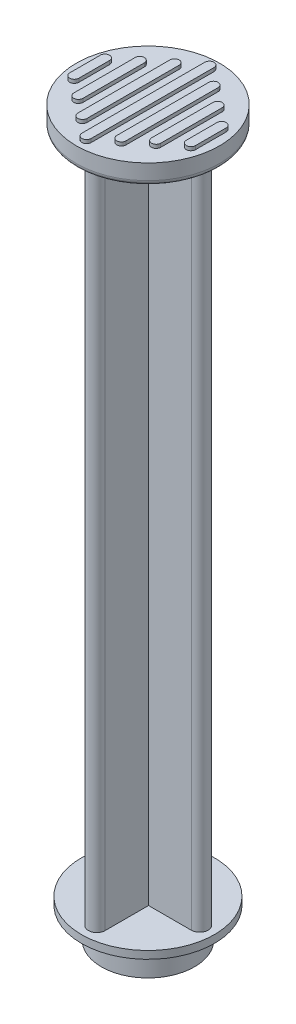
ISO-10303-21;
HEADER;
FILE_DESCRIPTION(('STEP AP214'),'2;1');
FILE_NAME('part.step','',(''),(''),'','','');
FILE_SCHEMA(('AUTOMOTIVE_DESIGN { 1 0 10303 214 1 1 1 1 }'));
ENDSEC;
DATA;
#1=APPLICATION_CONTEXT('core data for automotive mechanical design processes');
#2=APPLICATION_PROTOCOL_DEFINITION('international standard','automotive_design',2000,#1);
#3=PRODUCT_CONTEXT('',#1,'mechanical');
#4=PRODUCT('Part','Part','',(#3));
#5=PRODUCT_RELATED_PRODUCT_CATEGORY('part','',(#4));
#6=PRODUCT_DEFINITION_FORMATION('','',#4);
#7=PRODUCT_DEFINITION_CONTEXT('part definition',#1,'design');
#8=PRODUCT_DEFINITION('design','',#6,#7);
#9=PRODUCT_DEFINITION_SHAPE('','',#8);
#10=(LENGTH_UNIT() NAMED_UNIT(*) SI_UNIT(.MILLI.,.METRE.));
#11=(NAMED_UNIT(*) PLANE_ANGLE_UNIT() SI_UNIT($,.RADIAN.));
#12=(NAMED_UNIT(*) SI_UNIT($,.STERADIAN.) SOLID_ANGLE_UNIT());
#13=UNCERTAINTY_MEASURE_WITH_UNIT(LENGTH_MEASURE(1.E-05),#10,'distance_accuracy_value','');
#14=(GEOMETRIC_REPRESENTATION_CONTEXT(3) GLOBAL_UNCERTAINTY_ASSIGNED_CONTEXT((#13)) GLOBAL_UNIT_ASSIGNED_CONTEXT((#10,
#11,#12)) REPRESENTATION_CONTEXT('',''));
#15=CARTESIAN_POINT('',(0.,0.,0.));
#16=DIRECTION('',(0.,0.,1.));
#17=DIRECTION('',(1.,0.,0.));
#18=AXIS2_PLACEMENT_3D('',#15,#16,#17);
#19=CARTESIAN_POINT('',(0.,70.71,0.));
#20=DIRECTION('',(0.,1.,0.));
#21=DIRECTION('',(0.,0.,1.));
#22=AXIS2_PLACEMENT_3D('',#19,#20,#21);
#23=PLANE('',#22);
#24=CARTESIAN_POINT('',(0.,70.71,0.));
#25=DIRECTION('',(0.,1.,0.));
#26=DIRECTION('',(0.,0.,1.));
#27=AXIS2_PLACEMENT_3D('',#24,#25,#26);
#28=CIRCLE('',#27,7.);
#29=CARTESIAN_POINT('',(0.,70.71,7.));
#30=VERTEX_POINT('',#29);
#31=EDGE_CURVE('E497',#30,#30,#28,.T.);
#32=ORIENTED_EDGE('',*,*,#31,.T.);
#33=EDGE_LOOP('',(#32));
#34=FACE_BOUND('',#33,.T.);
#35=DIRECTION('',(0.,0.,-1.));
#36=VECTOR('',#35,1.);
#37=CARTESIAN_POINT('',(0.450000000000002,70.71,6.));
#38=LINE('',#37,#36);
#39=CARTESIAN_POINT('',(0.450000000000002,70.71,6.));
#40=VERTEX_POINT('',#39);
#41=CARTESIAN_POINT('',(0.449999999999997,70.71,-6.));
#42=VERTEX_POINT('',#41);
#43=EDGE_CURVE('E482',#40,#42,#38,.T.);
#44=ORIENTED_EDGE('',*,*,#43,.F.);
#45=CARTESIAN_POINT('',(0.,70.71,6.));
#46=DIRECTION('',(0.,1.,0.));
#47=DIRECTION('',(0.,0.,1.));
#48=AXIS2_PLACEMENT_3D('',#45,#46,#47);
#49=CIRCLE('',#48,0.45);
#50=CARTESIAN_POINT('',(-0.449999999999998,70.71,6.));
#51=VERTEX_POINT('',#50);
#52=EDGE_CURVE('E461',#51,#40,#49,.T.);
#53=ORIENTED_EDGE('',*,*,#52,.F.);
#54=DIRECTION('',(0.,0.,1.));
#55=VECTOR('',#54,1.);
#56=CARTESIAN_POINT('',(-0.449999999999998,70.71,6.));
#57=LINE('',#56,#55);
#58=CARTESIAN_POINT('',(-0.450000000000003,70.71,-6.));
#59=VERTEX_POINT('',#58);
#60=EDGE_CURVE('E473',#59,#51,#57,.T.);
#61=ORIENTED_EDGE('',*,*,#60,.F.);
#62=CARTESIAN_POINT('',(0.,70.71,-6.));
#63=DIRECTION('',(0.,1.,0.));
#64=DIRECTION('',(0.,0.,1.));
#65=AXIS2_PLACEMENT_3D('',#62,#63,#64);
#66=CIRCLE('',#65,0.45);
#67=EDGE_CURVE('E484',#42,#59,#66,.T.);
#68=ORIENTED_EDGE('',*,*,#67,.F.);
#69=EDGE_LOOP('',(#44,#53,#61,#68));
#70=FACE_BOUND('',#69,.T.);
#71=DIRECTION('',(0.,0.,1.));
#72=VECTOR('',#71,1.);
#73=CARTESIAN_POINT('',(1.45,70.71,-4.5));
#74=LINE('',#73,#72);
#75=CARTESIAN_POINT('',(1.45,70.71,-4.5));
#76=VERTEX_POINT('',#75);
#77=CARTESIAN_POINT('',(1.45,70.71,4.5));
#78=VERTEX_POINT('',#77);
#79=EDGE_CURVE('E456',#76,#78,#74,.T.);
#80=ORIENTED_EDGE('',*,*,#79,.F.);
#81=CARTESIAN_POINT('',(1.9,70.71,-4.5));
#82=DIRECTION('',(0.,1.,0.));
#83=DIRECTION('',(0.,0.,1.));
#84=AXIS2_PLACEMENT_3D('',#81,#82,#83);
#85=CIRCLE('',#84,0.449999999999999);
#86=CARTESIAN_POINT('',(2.35,70.71,-4.5));
#87=VERTEX_POINT('',#86);
#88=EDGE_CURVE('E458',#87,#76,#85,.T.);
#89=ORIENTED_EDGE('',*,*,#88,.F.);
#90=DIRECTION('',(0.,0.,-1.));
#91=VECTOR('',#90,1.);
#92=CARTESIAN_POINT('',(2.35,70.71,-4.5));
#93=LINE('',#92,#91);
#94=CARTESIAN_POINT('',(2.35,70.71,4.5));
#95=VERTEX_POINT('',#94);
#96=EDGE_CURVE('E450',#95,#87,#93,.T.);
#97=ORIENTED_EDGE('',*,*,#96,.F.);
#98=CARTESIAN_POINT('',(1.9,70.71,4.5));
#99=DIRECTION('',(0.,1.,0.));
#100=DIRECTION('',(0.,0.,1.));
#101=AXIS2_PLACEMENT_3D('',#98,#99,#100);
#102=CIRCLE('',#101,0.449999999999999);
#103=EDGE_CURVE('E452',#78,#95,#102,.T.);
#104=ORIENTED_EDGE('',*,*,#103,.F.);
#105=EDGE_LOOP('',(#80,#89,#97,#104));
#106=FACE_BOUND('',#105,.T.);
#107=DIRECTION('',(0.,0.,1.));
#108=VECTOR('',#107,1.);
#109=CARTESIAN_POINT('',(5.25,70.71,-1.5));
#110=LINE('',#109,#108);
#111=CARTESIAN_POINT('',(5.25,70.71,-1.5));
#112=VERTEX_POINT('',#111);
#113=CARTESIAN_POINT('',(5.25,70.71,1.5));
#114=VERTEX_POINT('',#113);
#115=EDGE_CURVE('E427',#112,#114,#110,.T.);
#116=ORIENTED_EDGE('',*,*,#115,.F.);
#117=CARTESIAN_POINT('',(5.7,70.71,-1.5));
#118=DIRECTION('',(0.,1.,0.));
#119=DIRECTION('',(0.,0.,1.));
#120=AXIS2_PLACEMENT_3D('',#117,#118,#119);
#121=CIRCLE('',#120,0.449999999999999);
#122=CARTESIAN_POINT('',(6.15,70.71,-1.5));
#123=VERTEX_POINT('',#122);
#124=EDGE_CURVE('E429',#123,#112,#121,.T.);
#125=ORIENTED_EDGE('',*,*,#124,.F.);
#126=DIRECTION('',(0.,0.,-1.));
#127=VECTOR('',#126,1.);
#128=CARTESIAN_POINT('',(6.15,70.71,-1.5));
#129=LINE('',#128,#127);
#130=CARTESIAN_POINT('',(6.15,70.71,1.5));
#131=VERTEX_POINT('',#130);
#132=EDGE_CURVE('E421',#131,#123,#129,.T.);
#133=ORIENTED_EDGE('',*,*,#132,.F.);
#134=CARTESIAN_POINT('',(5.7,70.71,1.5));
#135=DIRECTION('',(0.,1.,0.));
#136=DIRECTION('',(0.,0.,1.));
#137=AXIS2_PLACEMENT_3D('',#134,#135,#136);
#138=CIRCLE('',#137,0.449999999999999);
#139=EDGE_CURVE('E423',#114,#131,#138,.T.);
#140=ORIENTED_EDGE('',*,*,#139,.F.);
#141=EDGE_LOOP('',(#116,#125,#133,#140));
#142=FACE_BOUND('',#141,.T.);
#143=DIRECTION('',(0.,0.,1.));
#144=VECTOR('',#143,1.);
#145=CARTESIAN_POINT('',(3.35,70.71,-3.));
#146=LINE('',#145,#144);
#147=CARTESIAN_POINT('',(3.35,70.71,-3.));
#148=VERTEX_POINT('',#147);
#149=CARTESIAN_POINT('',(3.35,70.71,3.));
#150=VERTEX_POINT('',#149);
#151=EDGE_CURVE('E398',#148,#150,#146,.T.);
#152=ORIENTED_EDGE('',*,*,#151,.F.);
#153=CARTESIAN_POINT('',(3.8,70.71,-3.));
#154=DIRECTION('',(0.,1.,0.));
#155=DIRECTION('',(0.,0.,1.));
#156=AXIS2_PLACEMENT_3D('',#153,#154,#155);
#157=CIRCLE('',#156,0.45);
#158=CARTESIAN_POINT('',(4.25,70.71,-3.));
#159=VERTEX_POINT('',#158);
#160=EDGE_CURVE('E400',#159,#148,#157,.T.);
#161=ORIENTED_EDGE('',*,*,#160,.F.);
#162=DIRECTION('',(0.,0.,-1.));
#163=VECTOR('',#162,1.);
#164=CARTESIAN_POINT('',(4.25,70.71,-3.));
#165=LINE('',#164,#163);
#166=CARTESIAN_POINT('',(4.25,70.71,3.));
#167=VERTEX_POINT('',#166);
#168=EDGE_CURVE('E392',#167,#159,#165,.T.);
#169=ORIENTED_EDGE('',*,*,#168,.F.);
#170=CARTESIAN_POINT('',(3.8,70.71,3.));
#171=DIRECTION('',(0.,1.,0.));
#172=DIRECTION('',(0.,0.,1.));
#173=AXIS2_PLACEMENT_3D('',#170,#171,#172);
#174=CIRCLE('',#173,0.45);
#175=EDGE_CURVE('E394',#150,#167,#174,.T.);
#176=ORIENTED_EDGE('',*,*,#175,.F.);
#177=EDGE_LOOP('',(#152,#161,#169,#176));
#178=FACE_BOUND('',#177,.T.);
#179=DIRECTION('',(0.,0.,1.));
#180=VECTOR('',#179,1.);
#181=CARTESIAN_POINT('',(-6.15,70.71,-1.5));
#182=LINE('',#181,#180);
#183=CARTESIAN_POINT('',(-6.15,70.71,-1.5));
#184=VERTEX_POINT('',#183);
#185=CARTESIAN_POINT('',(-6.15,70.71,1.5));
#186=VERTEX_POINT('',#185);
#187=EDGE_CURVE('E369',#184,#186,#182,.T.);
#188=ORIENTED_EDGE('',*,*,#187,.F.);
#189=CARTESIAN_POINT('',(-5.7,70.71,-1.5));
#190=DIRECTION('',(0.,1.,0.));
#191=DIRECTION('',(0.,0.,-1.));
#192=AXIS2_PLACEMENT_3D('',#189,#190,#191);
#193=CIRCLE('',#192,0.449999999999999);
#194=CARTESIAN_POINT('',(-5.25,70.71,-1.5));
#195=VERTEX_POINT('',#194);
#196=EDGE_CURVE('E371',#195,#184,#193,.T.);
#197=ORIENTED_EDGE('',*,*,#196,.F.);
#198=DIRECTION('',(0.,0.,-1.));
#199=VECTOR('',#198,1.);
#200=CARTESIAN_POINT('',(-5.25,70.71,-1.5));
#201=LINE('',#200,#199);
#202=CARTESIAN_POINT('',(-5.25,70.71,1.5));
#203=VERTEX_POINT('',#202);
#204=EDGE_CURVE('E363',#203,#195,#201,.T.);
#205=ORIENTED_EDGE('',*,*,#204,.F.);
#206=CARTESIAN_POINT('',(-5.7,70.71,1.5));
#207=DIRECTION('',(0.,1.,0.));
#208=DIRECTION('',(0.,0.,-1.));
#209=AXIS2_PLACEMENT_3D('',#206,#207,#208);
#210=CIRCLE('',#209,0.449999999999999);
#211=EDGE_CURVE('E365',#186,#203,#210,.T.);
#212=ORIENTED_EDGE('',*,*,#211,.F.);
#213=EDGE_LOOP('',(#188,#197,#205,#212));
#214=FACE_BOUND('',#213,.T.);
#215=DIRECTION('',(0.,0.,1.));
#216=VECTOR('',#215,1.);
#217=CARTESIAN_POINT('',(-4.25,70.71,-3.));
#218=LINE('',#217,#216);
#219=CARTESIAN_POINT('',(-4.25,70.71,-3.));
#220=VERTEX_POINT('',#219);
#221=CARTESIAN_POINT('',(-4.25,70.71,3.));
#222=VERTEX_POINT('',#221);
#223=EDGE_CURVE('E340',#220,#222,#218,.T.);
#224=ORIENTED_EDGE('',*,*,#223,.F.);
#225=CARTESIAN_POINT('',(-3.8,70.71,-3.));
#226=DIRECTION('',(0.,1.,0.));
#227=DIRECTION('',(0.,0.,-1.));
#228=AXIS2_PLACEMENT_3D('',#225,#226,#227);
#229=CIRCLE('',#228,0.45);
#230=CARTESIAN_POINT('',(-3.35,70.71,-3.));
#231=VERTEX_POINT('',#230);
#232=EDGE_CURVE('E342',#231,#220,#229,.T.);
#233=ORIENTED_EDGE('',*,*,#232,.F.);
#234=DIRECTION('',(0.,0.,-1.));
#235=VECTOR('',#234,1.);
#236=CARTESIAN_POINT('',(-3.35,70.71,-3.));
#237=LINE('',#236,#235);
#238=CARTESIAN_POINT('',(-3.35,70.71,3.));
#239=VERTEX_POINT('',#238);
#240=EDGE_CURVE('E335',#239,#231,#237,.T.);
#241=ORIENTED_EDGE('',*,*,#240,.F.);
#242=CARTESIAN_POINT('',(-3.8,70.71,3.));
#243=DIRECTION('',(0.,1.,0.));
#244=DIRECTION('',(0.,0.,-1.));
#245=AXIS2_PLACEMENT_3D('',#242,#243,#244);
#246=CIRCLE('',#245,0.45);
#247=EDGE_CURVE('E337',#222,#239,#246,.T.);
#248=ORIENTED_EDGE('',*,*,#247,.F.);
#249=EDGE_LOOP('',(#224,#233,#241,#248));
#250=FACE_BOUND('',#249,.T.);
#251=DIRECTION('',(0.,0.,1.));
#252=VECTOR('',#251,1.);
#253=CARTESIAN_POINT('',(-2.35,70.71,-4.5));
#254=LINE('',#253,#252);
#255=CARTESIAN_POINT('',(-2.35,70.71,-4.5));
#256=VERTEX_POINT('',#255);
#257=CARTESIAN_POINT('',(-2.35,70.71,4.5));
#258=VERTEX_POINT('',#257);
#259=EDGE_CURVE('E314',#256,#258,#254,.T.);
#260=ORIENTED_EDGE('',*,*,#259,.F.);
#261=CARTESIAN_POINT('',(-1.9,70.71,-4.5));
#262=DIRECTION('',(0.,1.,0.));
#263=DIRECTION('',(0.,0.,-1.));
#264=AXIS2_PLACEMENT_3D('',#261,#262,#263);
#265=CIRCLE('',#264,0.449999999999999);
#266=CARTESIAN_POINT('',(-1.45,70.71,-4.5));
#267=VERTEX_POINT('',#266);
#268=EDGE_CURVE('E309',#267,#256,#265,.T.);
#269=ORIENTED_EDGE('',*,*,#268,.F.);
#270=DIRECTION('',(0.,0.,-1.));
#271=VECTOR('',#270,1.);
#272=CARTESIAN_POINT('',(-1.45,70.71,-4.5));
#273=LINE('',#272,#271);
#274=CARTESIAN_POINT('',(-1.45,70.71,4.5));
#275=VERTEX_POINT('',#274);
#276=EDGE_CURVE('E294',#275,#267,#273,.T.);
#277=ORIENTED_EDGE('',*,*,#276,.F.);
#278=CARTESIAN_POINT('',(-1.9,70.71,4.5));
#279=DIRECTION('',(0.,1.,0.));
#280=DIRECTION('',(0.,0.,-1.));
#281=AXIS2_PLACEMENT_3D('',#278,#279,#280);
#282=CIRCLE('',#281,0.449999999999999);
#283=EDGE_CURVE('E302',#258,#275,#282,.T.);
#284=ORIENTED_EDGE('',*,*,#283,.F.);
#285=EDGE_LOOP('',(#260,#269,#277,#284));
#286=FACE_BOUND('',#285,.T.);
#287=ADVANCED_FACE('F36',(#34,#70,#106,#142,#178,#214,#250,#286),#23,.T.);
#288=CARTESIAN_POINT('',(0.,1.83,0.));
#289=DIRECTION('',(0.,-1.,0.));
#290=DIRECTION('',(0.,0.,-1.));
#291=AXIS2_PLACEMENT_3D('',#288,#289,#290);
#292=CYLINDRICAL_SURFACE('',#291,4.55);
#293=CARTESIAN_POINT('',(0.,1.83,0.));
#294=DIRECTION('',(0.,1.,0.));
#295=DIRECTION('',(0.,0.,1.));
#296=AXIS2_PLACEMENT_3D('',#293,#294,#295);
#297=CIRCLE('',#296,4.55);
#298=CARTESIAN_POINT('',(0.,1.83,4.55));
#299=VERTEX_POINT('',#298);
#300=EDGE_CURVE('E621',#299,#299,#297,.T.);
#301=ORIENTED_EDGE('',*,*,#300,.F.);
#302=EDGE_LOOP('',(#301));
#303=FACE_BOUND('',#302,.T.);
#304=CARTESIAN_POINT('',(0.,0.,0.));
#305=DIRECTION('',(0.,1.,0.));
#306=DIRECTION('',(0.,0.,1.));
#307=AXIS2_PLACEMENT_3D('',#304,#305,#306);
#308=CIRCLE('',#307,4.55);
#309=CARTESIAN_POINT('',(0.,0.,4.55));
#310=VERTEX_POINT('',#309);
#311=EDGE_CURVE('E617',#310,#310,#308,.T.);
#312=ORIENTED_EDGE('',*,*,#311,.T.);
#313=EDGE_LOOP('',(#312));
#314=FACE_BOUND('',#313,.T.);
#315=ADVANCED_FACE('F645',(#303,#314),#292,.T.);
#316=CARTESIAN_POINT('',(0.,1.83,0.));
#317=DIRECTION('',(0.,1.,0.));
#318=DIRECTION('',(0.,0.,1.));
#319=AXIS2_PLACEMENT_3D('',#316,#317,#318);
#320=PLANE('',#319);
#321=CARTESIAN_POINT('',(0.,1.83,0.));
#322=DIRECTION('',(0.,1.,0.));
#323=DIRECTION('',(0.,0.,1.));
#324=AXIS2_PLACEMENT_3D('',#321,#322,#323);
#325=CIRCLE('',#324,2.47);
#326=CARTESIAN_POINT('',(0.,1.83,2.47));
#327=VERTEX_POINT('',#326);
#328=EDGE_CURVE('E618',#327,#327,#325,.T.);
#329=ORIENTED_EDGE('',*,*,#328,.F.);
#330=EDGE_LOOP('',(#329));
#331=FACE_BOUND('',#330,.T.);
#332=ORIENTED_EDGE('',*,*,#300,.T.);
#333=EDGE_LOOP('',(#332));
#334=FACE_BOUND('',#333,.T.);
#335=ADVANCED_FACE('F651',(#331,#334),#320,.T.);
#336=CARTESIAN_POINT('',(0.,0.,0.));
#337=DIRECTION('',(0.,1.,0.));
#338=DIRECTION('',(0.,0.,1.));
#339=AXIS2_PLACEMENT_3D('',#336,#337,#338);
#340=PLANE('',#339);
#341=ORIENTED_EDGE('',*,*,#311,.F.);
#342=EDGE_LOOP('',(#341));
#343=FACE_BOUND('',#342,.T.);
#344=ADVANCED_FACE('F722',(#343),#340,.F.);
#345=CARTESIAN_POINT('',(0.,2.96,0.));
#346=DIRECTION('',(0.,-1.,0.));
#347=DIRECTION('',(0.,0.,-1.));
#348=AXIS2_PLACEMENT_3D('',#345,#346,#347);
#349=CYLINDRICAL_SURFACE('',#348,2.47);
#350=CARTESIAN_POINT('',(0.,2.96,0.));
#351=DIRECTION('',(0.,1.,0.));
#352=DIRECTION('',(0.,0.,1.));
#353=AXIS2_PLACEMENT_3D('',#350,#351,#352);
#354=CIRCLE('',#353,2.47);
#355=CARTESIAN_POINT('',(0.,2.96,2.47));
#356=VERTEX_POINT('',#355);
#357=EDGE_CURVE('E612',#356,#356,#354,.T.);
#358=ORIENTED_EDGE('',*,*,#357,.F.);
#359=EDGE_LOOP('',(#358));
#360=FACE_BOUND('',#359,.T.);
#361=ORIENTED_EDGE('',*,*,#328,.T.);
#362=EDGE_LOOP('',(#361));
#363=FACE_BOUND('',#362,.T.);
#364=ADVANCED_FACE('F718',(#360,#363),#349,.T.);
#365=CARTESIAN_POINT('',(0.,3.71,0.));
#366=DIRECTION('',(0.,-1.,0.));
#367=DIRECTION('',(0.,0.,-1.));
#368=AXIS2_PLACEMENT_3D('',#365,#366,#367);
#369=CYLINDRICAL_SURFACE('',#368,6.5);
#370=CARTESIAN_POINT('',(0.,3.71,0.));
#371=DIRECTION('',(0.,1.,0.));
#372=DIRECTION('',(0.,0.,1.));
#373=AXIS2_PLACEMENT_3D('',#370,#371,#372);
#374=CIRCLE('',#373,6.5);
#375=CARTESIAN_POINT('',(0.,3.71,6.5));
#376=VERTEX_POINT('',#375);
#377=EDGE_CURVE('E609',#376,#376,#374,.T.);
#378=ORIENTED_EDGE('',*,*,#377,.F.);
#379=EDGE_LOOP('',(#378));
#380=FACE_BOUND('',#379,.T.);
#381=CARTESIAN_POINT('',(0.,2.96,0.));
#382=DIRECTION('',(0.,1.,0.));
#383=DIRECTION('',(0.,0.,1.));
#384=AXIS2_PLACEMENT_3D('',#381,#382,#383);
#385=CIRCLE('',#384,6.5);
#386=CARTESIAN_POINT('',(0.,2.96,6.5));
#387=VERTEX_POINT('',#386);
#388=EDGE_CURVE('E608',#387,#387,#385,.T.);
#389=ORIENTED_EDGE('',*,*,#388,.T.);
#390=EDGE_LOOP('',(#389));
#391=FACE_BOUND('',#390,.T.);
#392=ADVANCED_FACE('F711',(#380,#391),#369,.T.);
#393=CARTESIAN_POINT('',(0.,3.71,0.));
#394=DIRECTION('',(0.,1.,0.));
#395=DIRECTION('',(0.,0.,1.));
#396=AXIS2_PLACEMENT_3D('',#393,#394,#395);
#397=PLANE('',#396);
#398=CARTESIAN_POINT('',(0.,3.71,-5.));
#399=DIRECTION('',(0.,1.,0.));
#400=DIRECTION('',(0.,0.,1.));
#401=AXIS2_PLACEMENT_3D('',#398,#399,#400);
#402=CIRCLE('',#401,0.819346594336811);
#403=CARTESIAN_POINT('',(0.819346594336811,3.71,-5.));
#404=VERTEX_POINT('',#403);
#405=CARTESIAN_POINT('',(-0.81934659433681,3.71,-5.));
#406=VERTEX_POINT('',#405);
#407=EDGE_CURVE('E500',#404,#406,#402,.T.);
#408=ORIENTED_EDGE('',*,*,#407,.F.);
#409=DIRECTION('',(0.,0.,-1.));
#410=VECTOR('',#409,1.);
#411=CARTESIAN_POINT('',(0.819346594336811,3.71,-5.));
#412=LINE('',#411,#410);
#413=CARTESIAN_POINT('',(0.819346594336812,3.71,-0.876852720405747));
#414=VERTEX_POINT('',#413);
#415=EDGE_CURVE('E505',#414,#404,#412,.T.);
#416=ORIENTED_EDGE('',*,*,#415,.F.);
#417=DIRECTION('',(-1.,0.,0.));
#418=VECTOR('',#417,1.);
#419=CARTESIAN_POINT('',(5.,3.71,-0.876852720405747));
#420=LINE('',#419,#418);
#421=CARTESIAN_POINT('',(5.,3.71,-0.876852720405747));
#422=VERTEX_POINT('',#421);
#423=EDGE_CURVE('E568',#422,#414,#420,.T.);
#424=ORIENTED_EDGE('',*,*,#423,.F.);
#425=CARTESIAN_POINT('',(5.,3.71,-0.0568527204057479));
#426=DIRECTION('',(0.,1.,0.));
#427=DIRECTION('',(0.,0.,1.));
#428=AXIS2_PLACEMENT_3D('',#425,#426,#427);
#429=CIRCLE('',#428,0.82);
#430=CARTESIAN_POINT('',(5.,3.71,0.763147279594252));
#431=VERTEX_POINT('',#430);
#432=EDGE_CURVE('E565',#431,#422,#429,.T.);
#433=ORIENTED_EDGE('',*,*,#432,.F.);
#434=DIRECTION('',(1.,0.,0.));
#435=VECTOR('',#434,1.);
#436=CARTESIAN_POINT('',(5.,3.71,0.763147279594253));
#437=LINE('',#436,#435);
#438=CARTESIAN_POINT('',(0.819346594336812,3.71,0.763147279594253));
#439=VERTEX_POINT('',#438);
#440=EDGE_CURVE('E562',#439,#431,#437,.T.);
#441=ORIENTED_EDGE('',*,*,#440,.F.);
#442=DIRECTION('',(0.,0.,-1.));
#443=VECTOR('',#442,1.);
#444=CARTESIAN_POINT('',(0.819346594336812,3.71,0.763147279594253));
#445=LINE('',#444,#443);
#446=CARTESIAN_POINT('',(0.819346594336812,3.71,5.));
#447=VERTEX_POINT('',#446);
#448=EDGE_CURVE('E559',#447,#439,#445,.T.);
#449=ORIENTED_EDGE('',*,*,#448,.F.);
#450=CARTESIAN_POINT('',(0.,3.71,5.));
#451=DIRECTION('',(0.,1.,0.));
#452=DIRECTION('',(0.,0.,1.));
#453=AXIS2_PLACEMENT_3D('',#450,#451,#452);
#454=CIRCLE('',#453,0.819346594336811);
#455=CARTESIAN_POINT('',(-0.81934659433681,3.71,5.));
#456=VERTEX_POINT('',#455);
#457=EDGE_CURVE('E556',#456,#447,#454,.T.);
#458=ORIENTED_EDGE('',*,*,#457,.F.);
#459=DIRECTION('',(0.,0.,1.));
#460=VECTOR('',#459,1.);
#461=CARTESIAN_POINT('',(-0.819346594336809,3.71,0.763147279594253));
#462=LINE('',#461,#460);
#463=CARTESIAN_POINT('',(-0.819346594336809,3.71,0.763147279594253));
#464=VERTEX_POINT('',#463);
#465=EDGE_CURVE('E553',#464,#456,#462,.T.);
#466=ORIENTED_EDGE('',*,*,#465,.F.);
#467=DIRECTION('',(1.,0.,0.));
#468=VECTOR('',#467,1.);
#469=CARTESIAN_POINT('',(-0.819346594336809,3.71,0.763147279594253));
#470=LINE('',#469,#468);
#471=CARTESIAN_POINT('',(-5.,3.71,0.763147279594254));
#472=VERTEX_POINT('',#471);
#473=EDGE_CURVE('E550',#472,#464,#470,.T.);
#474=ORIENTED_EDGE('',*,*,#473,.F.);
#475=CARTESIAN_POINT('',(-5.,3.71,-0.0568527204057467));
#476=DIRECTION('',(0.,1.,0.));
#477=DIRECTION('',(0.,0.,1.));
#478=AXIS2_PLACEMENT_3D('',#475,#476,#477);
#479=CIRCLE('',#478,0.82);
#480=CARTESIAN_POINT('',(-5.,3.71,-0.876852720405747));
#481=VERTEX_POINT('',#480);
#482=EDGE_CURVE('E547',#481,#472,#479,.T.);
#483=ORIENTED_EDGE('',*,*,#482,.F.);
#484=DIRECTION('',(-1.,0.,0.));
#485=VECTOR('',#484,1.);
#486=CARTESIAN_POINT('',(-0.819346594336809,3.71,-0.876852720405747));
#487=LINE('',#486,#485);
#488=CARTESIAN_POINT('',(-0.819346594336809,3.71,-0.876852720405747));
#489=VERTEX_POINT('',#488);
#490=EDGE_CURVE('E544',#489,#481,#487,.T.);
#491=ORIENTED_EDGE('',*,*,#490,.F.);
#492=DIRECTION('',(0.,0.,1.));
#493=VECTOR('',#492,1.);
#494=CARTESIAN_POINT('',(-0.81934659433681,3.71,-5.));
#495=LINE('',#494,#493);
#496=EDGE_CURVE('E541',#406,#489,#495,.T.);
#497=ORIENTED_EDGE('',*,*,#496,.F.);
#498=EDGE_LOOP('',(#408,#416,#424,#433,#441,#449,#458,#466,#474,#483,#491,#497));
#499=FACE_BOUND('',#498,.T.);
#500=ORIENTED_EDGE('',*,*,#377,.T.);
#501=EDGE_LOOP('',(#500));
#502=FACE_BOUND('',#501,.T.);
#503=ADVANCED_FACE('F708',(#499,#502),#397,.T.);
#504=CARTESIAN_POINT('',(0.,2.96,0.));
#505=DIRECTION('',(0.,1.,0.));
#506=DIRECTION('',(0.,0.,1.));
#507=AXIS2_PLACEMENT_3D('',#504,#505,#506);
#508=PLANE('',#507);
#509=ORIENTED_EDGE('',*,*,#357,.T.);
#510=EDGE_LOOP('',(#509));
#511=FACE_BOUND('',#510,.T.);
#512=ORIENTED_EDGE('',*,*,#388,.F.);
#513=EDGE_LOOP('',(#512));
#514=FACE_BOUND('',#513,.T.);
#515=ADVANCED_FACE('F706',(#511,#514),#508,.F.);
#516=CARTESIAN_POINT('',(0.,68.71,-5.));
#517=DIRECTION('',(0.,-1.,0.));
#518=DIRECTION('',(0.,0.,-1.));
#519=AXIS2_PLACEMENT_3D('',#516,#517,#518);
#520=CYLINDRICAL_SURFACE('',#519,0.819346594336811);
#521=ORIENTED_EDGE('',*,*,#407,.T.);
#522=DIRECTION('',(0.,-1.,0.));
#523=VECTOR('',#522,1.);
#524=CARTESIAN_POINT('',(-0.81934659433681,68.71,-5.));
#525=LINE('',#524,#523);
#526=CARTESIAN_POINT('',(-0.81934659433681,68.71,-5.));
#527=VERTEX_POINT('',#526);
#528=EDGE_CURVE('E605',#527,#406,#525,.T.);
#529=ORIENTED_EDGE('',*,*,#528,.F.);
#530=CARTESIAN_POINT('',(0.,68.71,-5.));
#531=DIRECTION('',(0.,1.,0.));
#532=DIRECTION('',(0.,0.,1.));
#533=AXIS2_PLACEMENT_3D('',#530,#531,#532);
#534=CIRCLE('',#533,0.819346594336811);
#535=CARTESIAN_POINT('',(0.819346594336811,68.71,-5.));
#536=VERTEX_POINT('',#535);
#537=EDGE_CURVE('E501',#536,#527,#534,.T.);
#538=ORIENTED_EDGE('',*,*,#537,.F.);
#539=DIRECTION('',(0.,-1.,0.));
#540=VECTOR('',#539,1.);
#541=CARTESIAN_POINT('',(0.819346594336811,68.71,-5.));
#542=LINE('',#541,#540);
#543=EDGE_CURVE('E538',#536,#404,#542,.T.);
#544=ORIENTED_EDGE('',*,*,#543,.T.);
#545=EDGE_LOOP('',(#521,#529,#538,#544));
#546=FACE_BOUND('',#545,.T.);
#547=ADVANCED_FACE('F702',(#546),#520,.T.);
#548=CARTESIAN_POINT('',(-0.81934659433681,68.71,-5.));
#549=DIRECTION('',(1.,0.,0.));
#550=DIRECTION('',(0.,0.,-1.));
#551=AXIS2_PLACEMENT_3D('',#548,#549,#550);
#552=PLANE('',#551);
#553=ORIENTED_EDGE('',*,*,#496,.T.);
#554=DIRECTION('',(0.,-1.,0.));
#555=VECTOR('',#554,1.);
#556=CARTESIAN_POINT('',(-0.819346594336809,68.71,-0.876852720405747));
#557=LINE('',#556,#555);
#558=CARTESIAN_POINT('',(-0.819346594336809,68.71,-0.876852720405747));
#559=VERTEX_POINT('',#558);
#560=EDGE_CURVE('E602',#559,#489,#557,.T.);
#561=ORIENTED_EDGE('',*,*,#560,.F.);
#562=DIRECTION('',(0.,0.,1.));
#563=VECTOR('',#562,1.);
#564=CARTESIAN_POINT('',(-0.81934659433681,68.71,-5.));
#565=LINE('',#564,#563);
#566=EDGE_CURVE('E504',#527,#559,#565,.T.);
#567=ORIENTED_EDGE('',*,*,#566,.F.);
#568=ORIENTED_EDGE('',*,*,#528,.T.);
#569=EDGE_LOOP('',(#553,#561,#567,#568));
#570=FACE_BOUND('',#569,.T.);
#571=ADVANCED_FACE('F698',(#570),#552,.F.);
#572=CARTESIAN_POINT('',(-0.819346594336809,68.71,-0.876852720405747));
#573=DIRECTION('',(0.,0.,1.));
#574=DIRECTION('',(1.,0.,0.));
#575=AXIS2_PLACEMENT_3D('',#572,#573,#574);
#576=PLANE('',#575);
#577=ORIENTED_EDGE('',*,*,#490,.T.);
#578=DIRECTION('',(0.,-1.,0.));
#579=VECTOR('',#578,1.);
#580=CARTESIAN_POINT('',(-5.,68.71,-0.876852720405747));
#581=LINE('',#580,#579);
#582=CARTESIAN_POINT('',(-5.,68.71,-0.876852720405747));
#583=VERTEX_POINT('',#582);
#584=EDGE_CURVE('E599',#583,#481,#581,.T.);
#585=ORIENTED_EDGE('',*,*,#584,.F.);
#586=DIRECTION('',(-1.,0.,0.));
#587=VECTOR('',#586,1.);
#588=CARTESIAN_POINT('',(-0.819346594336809,68.71,-0.876852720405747));
#589=LINE('',#588,#587);
#590=EDGE_CURVE('E508',#559,#583,#589,.T.);
#591=ORIENTED_EDGE('',*,*,#590,.F.);
#592=ORIENTED_EDGE('',*,*,#560,.T.);
#593=EDGE_LOOP('',(#577,#585,#591,#592));
#594=FACE_BOUND('',#593,.T.);
#595=ADVANCED_FACE('F694',(#594),#576,.F.);
#596=CARTESIAN_POINT('',(-5.,68.71,-0.0568527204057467));
#597=DIRECTION('',(0.,-1.,0.));
#598=DIRECTION('',(0.,0.,-1.));
#599=AXIS2_PLACEMENT_3D('',#596,#597,#598);
#600=CYLINDRICAL_SURFACE('',#599,0.82);
#601=ORIENTED_EDGE('',*,*,#482,.T.);
#602=DIRECTION('',(0.,-1.,0.));
#603=VECTOR('',#602,1.);
#604=CARTESIAN_POINT('',(-5.,68.71,0.763147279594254));
#605=LINE('',#604,#603);
#606=CARTESIAN_POINT('',(-5.,68.71,0.763147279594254));
#607=VERTEX_POINT('',#606);
#608=EDGE_CURVE('E596',#607,#472,#605,.T.);
#609=ORIENTED_EDGE('',*,*,#608,.F.);
#610=CARTESIAN_POINT('',(-5.,68.71,-0.0568527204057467));
#611=DIRECTION('',(0.,1.,0.));
#612=DIRECTION('',(0.,0.,1.));
#613=AXIS2_PLACEMENT_3D('',#610,#611,#612);
#614=CIRCLE('',#613,0.82);
#615=EDGE_CURVE('E511',#583,#607,#614,.T.);
#616=ORIENTED_EDGE('',*,*,#615,.F.);
#617=ORIENTED_EDGE('',*,*,#584,.T.);
#618=EDGE_LOOP('',(#601,#609,#616,#617));
#619=FACE_BOUND('',#618,.T.);
#620=ADVANCED_FACE('F690',(#619),#600,.T.);
#621=CARTESIAN_POINT('',(-0.819346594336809,68.71,0.763147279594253));
#622=DIRECTION('',(0.,0.,-1.));
#623=DIRECTION('',(-1.,0.,0.));
#624=AXIS2_PLACEMENT_3D('',#621,#622,#623);
#625=PLANE('',#624);
#626=ORIENTED_EDGE('',*,*,#473,.T.);
#627=DIRECTION('',(0.,-1.,0.));
#628=VECTOR('',#627,1.);
#629=CARTESIAN_POINT('',(-0.819346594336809,68.71,0.763147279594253));
#630=LINE('',#629,#628);
#631=CARTESIAN_POINT('',(-0.819346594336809,68.71,0.763147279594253));
#632=VERTEX_POINT('',#631);
#633=EDGE_CURVE('E593',#632,#464,#630,.T.);
#634=ORIENTED_EDGE('',*,*,#633,.F.);
#635=DIRECTION('',(1.,0.,0.));
#636=VECTOR('',#635,1.);
#637=CARTESIAN_POINT('',(-0.819346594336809,68.71,0.763147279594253));
#638=LINE('',#637,#636);
#639=EDGE_CURVE('E514',#607,#632,#638,.T.);
#640=ORIENTED_EDGE('',*,*,#639,.F.);
#641=ORIENTED_EDGE('',*,*,#608,.T.);
#642=EDGE_LOOP('',(#626,#634,#640,#641));
#643=FACE_BOUND('',#642,.T.);
#644=ADVANCED_FACE('F686',(#643),#625,.F.);
#645=CARTESIAN_POINT('',(-0.819346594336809,68.71,0.763147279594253));
#646=DIRECTION('',(1.,0.,0.));
#647=DIRECTION('',(0.,0.,-1.));
#648=AXIS2_PLACEMENT_3D('',#645,#646,#647);
#649=PLANE('',#648);
#650=ORIENTED_EDGE('',*,*,#465,.T.);
#651=DIRECTION('',(0.,-1.,0.));
#652=VECTOR('',#651,1.);
#653=CARTESIAN_POINT('',(-0.81934659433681,68.71,5.));
#654=LINE('',#653,#652);
#655=CARTESIAN_POINT('',(-0.81934659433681,68.71,5.));
#656=VERTEX_POINT('',#655);
#657=EDGE_CURVE('E590',#656,#456,#654,.T.);
#658=ORIENTED_EDGE('',*,*,#657,.F.);
#659=DIRECTION('',(0.,0.,1.));
#660=VECTOR('',#659,1.);
#661=CARTESIAN_POINT('',(-0.819346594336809,68.71,0.763147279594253));
#662=LINE('',#661,#660);
#663=EDGE_CURVE('E517',#632,#656,#662,.T.);
#664=ORIENTED_EDGE('',*,*,#663,.F.);
#665=ORIENTED_EDGE('',*,*,#633,.T.);
#666=EDGE_LOOP('',(#650,#658,#664,#665));
#667=FACE_BOUND('',#666,.T.);
#668=ADVANCED_FACE('F682',(#667),#649,.F.);
#669=CARTESIAN_POINT('',(0.,68.71,5.));
#670=DIRECTION('',(0.,-1.,0.));
#671=DIRECTION('',(0.,0.,-1.));
#672=AXIS2_PLACEMENT_3D('',#669,#670,#671);
#673=CYLINDRICAL_SURFACE('',#672,0.819346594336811);
#674=ORIENTED_EDGE('',*,*,#457,.T.);
#675=DIRECTION('',(0.,-1.,0.));
#676=VECTOR('',#675,1.);
#677=CARTESIAN_POINT('',(0.819346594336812,68.71,5.));
#678=LINE('',#677,#676);
#679=CARTESIAN_POINT('',(0.819346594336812,68.71,5.));
#680=VERTEX_POINT('',#679);
#681=EDGE_CURVE('E587',#680,#447,#678,.T.);
#682=ORIENTED_EDGE('',*,*,#681,.F.);
#683=CARTESIAN_POINT('',(0.,68.71,5.));
#684=DIRECTION('',(0.,1.,0.));
#685=DIRECTION('',(0.,0.,1.));
#686=AXIS2_PLACEMENT_3D('',#683,#684,#685);
#687=CIRCLE('',#686,0.819346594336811);
#688=EDGE_CURVE('E520',#656,#680,#687,.T.);
#689=ORIENTED_EDGE('',*,*,#688,.F.);
#690=ORIENTED_EDGE('',*,*,#657,.T.);
#691=EDGE_LOOP('',(#674,#682,#689,#690));
#692=FACE_BOUND('',#691,.T.);
#693=ADVANCED_FACE('F678',(#692),#673,.T.);
#694=CARTESIAN_POINT('',(0.819346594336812,68.71,0.763147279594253));
#695=DIRECTION('',(-1.,0.,0.));
#696=DIRECTION('',(0.,0.,1.));
#697=AXIS2_PLACEMENT_3D('',#694,#695,#696);
#698=PLANE('',#697);
#699=ORIENTED_EDGE('',*,*,#448,.T.);
#700=DIRECTION('',(0.,-1.,0.));
#701=VECTOR('',#700,1.);
#702=CARTESIAN_POINT('',(0.819346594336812,68.71,0.763147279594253));
#703=LINE('',#702,#701);
#704=CARTESIAN_POINT('',(0.819346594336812,68.71,0.763147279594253));
#705=VERTEX_POINT('',#704);
#706=EDGE_CURVE('E584',#705,#439,#703,.T.);
#707=ORIENTED_EDGE('',*,*,#706,.F.);
#708=DIRECTION('',(0.,0.,-1.));
#709=VECTOR('',#708,1.);
#710=CARTESIAN_POINT('',(0.819346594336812,68.71,0.763147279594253));
#711=LINE('',#710,#709);
#712=EDGE_CURVE('E523',#680,#705,#711,.T.);
#713=ORIENTED_EDGE('',*,*,#712,.F.);
#714=ORIENTED_EDGE('',*,*,#681,.T.);
#715=EDGE_LOOP('',(#699,#707,#713,#714));
#716=FACE_BOUND('',#715,.T.);
#717=ADVANCED_FACE('F674',(#716),#698,.F.);
#718=CARTESIAN_POINT('',(5.,68.71,0.763147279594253));
#719=DIRECTION('',(0.,0.,-1.));
#720=DIRECTION('',(-1.,0.,0.));
#721=AXIS2_PLACEMENT_3D('',#718,#719,#720);
#722=PLANE('',#721);
#723=ORIENTED_EDGE('',*,*,#440,.T.);
#724=DIRECTION('',(0.,-1.,0.));
#725=VECTOR('',#724,1.);
#726=CARTESIAN_POINT('',(5.,68.71,0.763147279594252));
#727=LINE('',#726,#725);
#728=CARTESIAN_POINT('',(5.,68.71,0.763147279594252));
#729=VERTEX_POINT('',#728);
#730=EDGE_CURVE('E581',#729,#431,#727,.T.);
#731=ORIENTED_EDGE('',*,*,#730,.F.);
#732=DIRECTION('',(1.,0.,0.));
#733=VECTOR('',#732,1.);
#734=CARTESIAN_POINT('',(5.,68.71,0.763147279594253));
#735=LINE('',#734,#733);
#736=EDGE_CURVE('E526',#705,#729,#735,.T.);
#737=ORIENTED_EDGE('',*,*,#736,.F.);
#738=ORIENTED_EDGE('',*,*,#706,.T.);
#739=EDGE_LOOP('',(#723,#731,#737,#738));
#740=FACE_BOUND('',#739,.T.);
#741=ADVANCED_FACE('F670',(#740),#722,.F.);
#742=CARTESIAN_POINT('',(5.,68.71,-0.0568527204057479));
#743=DIRECTION('',(0.,-1.,0.));
#744=DIRECTION('',(0.,0.,-1.));
#745=AXIS2_PLACEMENT_3D('',#742,#743,#744);
#746=CYLINDRICAL_SURFACE('',#745,0.82);
#747=ORIENTED_EDGE('',*,*,#432,.T.);
#748=DIRECTION('',(0.,-1.,0.));
#749=VECTOR('',#748,1.);
#750=CARTESIAN_POINT('',(5.,68.71,-0.876852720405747));
#751=LINE('',#750,#749);
#752=CARTESIAN_POINT('',(5.,68.71,-0.876852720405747));
#753=VERTEX_POINT('',#752);
#754=EDGE_CURVE('E578',#753,#422,#751,.T.);
#755=ORIENTED_EDGE('',*,*,#754,.F.);
#756=CARTESIAN_POINT('',(5.,68.71,-0.0568527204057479));
#757=DIRECTION('',(0.,1.,0.));
#758=DIRECTION('',(0.,0.,1.));
#759=AXIS2_PLACEMENT_3D('',#756,#757,#758);
#760=CIRCLE('',#759,0.82);
#761=EDGE_CURVE('E529',#729,#753,#760,.T.);
#762=ORIENTED_EDGE('',*,*,#761,.F.);
#763=ORIENTED_EDGE('',*,*,#730,.T.);
#764=EDGE_LOOP('',(#747,#755,#762,#763));
#765=FACE_BOUND('',#764,.T.);
#766=ADVANCED_FACE('F666',(#765),#746,.T.);
#767=CARTESIAN_POINT('',(5.,68.71,-0.876852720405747));
#768=DIRECTION('',(0.,0.,1.));
#769=DIRECTION('',(1.,0.,0.));
#770=AXIS2_PLACEMENT_3D('',#767,#768,#769);
#771=PLANE('',#770);
#772=ORIENTED_EDGE('',*,*,#423,.T.);
#773=DIRECTION('',(0.,-1.,0.));
#774=VECTOR('',#773,1.);
#775=CARTESIAN_POINT('',(0.819346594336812,68.71,-0.876852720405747));
#776=LINE('',#775,#774);
#777=CARTESIAN_POINT('',(0.819346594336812,68.71,-0.876852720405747));
#778=VERTEX_POINT('',#777);
#779=EDGE_CURVE('E575',#778,#414,#776,.T.);
#780=ORIENTED_EDGE('',*,*,#779,.F.);
#781=DIRECTION('',(-1.,0.,0.));
#782=VECTOR('',#781,1.);
#783=CARTESIAN_POINT('',(5.,68.71,-0.876852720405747));
#784=LINE('',#783,#782);
#785=EDGE_CURVE('E532',#753,#778,#784,.T.);
#786=ORIENTED_EDGE('',*,*,#785,.F.);
#787=ORIENTED_EDGE('',*,*,#754,.T.);
#788=EDGE_LOOP('',(#772,#780,#786,#787));
#789=FACE_BOUND('',#788,.T.);
#790=ADVANCED_FACE('F662',(#789),#771,.F.);
#791=CARTESIAN_POINT('',(0.819346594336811,68.71,-5.));
#792=DIRECTION('',(-1.,0.,0.));
#793=DIRECTION('',(0.,0.,1.));
#794=AXIS2_PLACEMENT_3D('',#791,#792,#793);
#795=PLANE('',#794);
#796=ORIENTED_EDGE('',*,*,#415,.T.);
#797=ORIENTED_EDGE('',*,*,#543,.F.);
#798=DIRECTION('',(0.,0.,-1.));
#799=VECTOR('',#798,1.);
#800=CARTESIAN_POINT('',(0.819346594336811,68.71,-5.));
#801=LINE('',#800,#799);
#802=EDGE_CURVE('E535',#778,#536,#801,.T.);
#803=ORIENTED_EDGE('',*,*,#802,.F.);
#804=ORIENTED_EDGE('',*,*,#779,.T.);
#805=EDGE_LOOP('',(#796,#797,#803,#804));
#806=FACE_BOUND('',#805,.T.);
#807=ADVANCED_FACE('F657',(#806),#795,.F.);
#808=CARTESIAN_POINT('',(0.,68.71,0.));
#809=DIRECTION('',(0.,1.,0.));
#810=DIRECTION('',(0.,0.,1.));
#811=AXIS2_PLACEMENT_3D('',#808,#809,#810);
#812=PLANE('',#811);
#813=CARTESIAN_POINT('',(0.,68.71,0.));
#814=DIRECTION('',(0.,1.,0.));
#815=DIRECTION('',(0.,0.,1.));
#816=AXIS2_PLACEMENT_3D('',#813,#814,#815);
#817=CIRCLE('',#816,6.5);
#818=CARTESIAN_POINT('',(0.,68.71,6.5));
#819=VERTEX_POINT('',#818);
#820=EDGE_CURVE('E11',#819,#819,#817,.F.);
#821=ORIENTED_EDGE('',*,*,#820,.T.);
#822=EDGE_LOOP('',(#821));
#823=FACE_BOUND('',#822,.T.);
#824=ORIENTED_EDGE('',*,*,#802,.T.);
#825=ORIENTED_EDGE('',*,*,#537,.T.);
#826=ORIENTED_EDGE('',*,*,#566,.T.);
#827=ORIENTED_EDGE('',*,*,#590,.T.);
#828=ORIENTED_EDGE('',*,*,#615,.T.);
#829=ORIENTED_EDGE('',*,*,#639,.T.);
#830=ORIENTED_EDGE('',*,*,#663,.T.);
#831=ORIENTED_EDGE('',*,*,#688,.T.);
#832=ORIENTED_EDGE('',*,*,#712,.T.);
#833=ORIENTED_EDGE('',*,*,#736,.T.);
#834=ORIENTED_EDGE('',*,*,#761,.T.);
#835=ORIENTED_EDGE('',*,*,#785,.T.);
#836=EDGE_LOOP('',(#824,#825,#826,#827,#828,#829,#830,#831,#832,#833,#834,#835));
#837=FACE_BOUND('',#836,.T.);
#838=ADVANCED_FACE('F641',(#823,#837),#812,.F.);
#839=CARTESIAN_POINT('',(0.,70.71,0.));
#840=DIRECTION('',(0.,-1.,0.));
#841=DIRECTION('',(0.,0.,-1.));
#842=AXIS2_PLACEMENT_3D('',#839,#840,#841);
#843=CYLINDRICAL_SURFACE('',#842,7.);
#844=CARTESIAN_POINT('',(0.,69.21,0.));
#845=DIRECTION('',(0.,1.,0.));
#846=DIRECTION('',(0.,0.,1.));
#847=AXIS2_PLACEMENT_3D('',#844,#845,#846);
#848=CIRCLE('',#847,7.);
#849=CARTESIAN_POINT('',(0.,69.21,7.));
#850=VERTEX_POINT('',#849);
#851=EDGE_CURVE('E44',#850,#850,#848,.T.);
#852=ORIENTED_EDGE('',*,*,#851,.T.);
#853=EDGE_LOOP('',(#852));
#854=FACE_BOUND('',#853,.T.);
#855=ORIENTED_EDGE('',*,*,#31,.F.);
#856=EDGE_LOOP('',(#855));
#857=FACE_BOUND('',#856,.T.);
#858=ADVANCED_FACE('F628',(#854,#857),#843,.T.);
#859=CARTESIAN_POINT('',(0.,69.21,0.));
#860=DIRECTION('',(0.,1.,0.));
#861=DIRECTION('',(0.,0.,1.));
#862=AXIS2_PLACEMENT_3D('',#859,#860,#861);
#863=TOROIDAL_SURFACE('',#862,6.5,0.5);
#864=ORIENTED_EDGE('',*,*,#820,.F.);
#865=EDGE_LOOP('',(#864));
#866=FACE_BOUND('',#865,.T.);
#867=ORIENTED_EDGE('',*,*,#851,.F.);
#868=EDGE_LOOP('',(#867));
#869=FACE_BOUND('',#868,.T.);
#870=ADVANCED_FACE('F38',(#866,#869),#863,.T.);
#871=CARTESIAN_POINT('',(0.,71.06,6.));
#872=DIRECTION('',(0.,-1.,0.));
#873=DIRECTION('',(0.,0.,-1.));
#874=AXIS2_PLACEMENT_3D('',#871,#872,#873);
#875=CYLINDRICAL_SURFACE('',#874,0.45);
#876=ORIENTED_EDGE('',*,*,#52,.T.);
#877=DIRECTION('',(0.,-1.,0.));
#878=VECTOR('',#877,1.);
#879=CARTESIAN_POINT('',(0.450000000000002,71.06,6.));
#880=LINE('',#879,#878);
#881=CARTESIAN_POINT('',(0.450000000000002,71.06,6.));
#882=VERTEX_POINT('',#881);
#883=EDGE_CURVE('E495',#882,#40,#880,.T.);
#884=ORIENTED_EDGE('',*,*,#883,.F.);
#885=CARTESIAN_POINT('',(0.,71.06,6.));
#886=DIRECTION('',(0.,1.,0.));
#887=DIRECTION('',(0.,0.,1.));
#888=AXIS2_PLACEMENT_3D('',#885,#886,#887);
#889=CIRCLE('',#888,0.45);
#890=CARTESIAN_POINT('',(-0.449999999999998,71.06,6.));
#891=VERTEX_POINT('',#890);
#892=EDGE_CURVE('E469',#891,#882,#889,.T.);
#893=ORIENTED_EDGE('',*,*,#892,.F.);
#894=DIRECTION('',(0.,-1.,0.));
#895=VECTOR('',#894,1.);
#896=CARTESIAN_POINT('',(-0.449999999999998,71.06,6.));
#897=LINE('',#896,#895);
#898=EDGE_CURVE('E479',#891,#51,#897,.T.);
#899=ORIENTED_EDGE('',*,*,#898,.T.);
#900=EDGE_LOOP('',(#876,#884,#893,#899));
#901=FACE_BOUND('',#900,.T.);
#902=ADVANCED_FACE('F632',(#901),#875,.T.);
#903=CARTESIAN_POINT('',(0.450000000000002,71.06,6.));
#904=DIRECTION('',(-1.,0.,0.));
#905=DIRECTION('',(0.,0.,1.));
#906=AXIS2_PLACEMENT_3D('',#903,#904,#905);
#907=PLANE('',#906);
#908=ORIENTED_EDGE('',*,*,#43,.T.);
#909=DIRECTION('',(0.,-1.,0.));
#910=VECTOR('',#909,1.);
#911=CARTESIAN_POINT('',(0.449999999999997,71.06,-6.));
#912=LINE('',#911,#910);
#913=CARTESIAN_POINT('',(0.449999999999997,71.06,-6.));
#914=VERTEX_POINT('',#913);
#915=EDGE_CURVE('E492',#914,#42,#912,.T.);
#916=ORIENTED_EDGE('',*,*,#915,.F.);
#917=DIRECTION('',(0.,0.,-1.));
#918=VECTOR('',#917,1.);
#919=CARTESIAN_POINT('',(0.450000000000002,71.06,6.));
#920=LINE('',#919,#918);
#921=EDGE_CURVE('E472',#882,#914,#920,.T.);
#922=ORIENTED_EDGE('',*,*,#921,.F.);
#923=ORIENTED_EDGE('',*,*,#883,.T.);
#924=EDGE_LOOP('',(#908,#916,#922,#923));
#925=FACE_BOUND('',#924,.T.);
#926=ADVANCED_FACE('F638',(#925),#907,.F.);
#927=CARTESIAN_POINT('',(0.,71.06,-6.));
#928=DIRECTION('',(0.,-1.,0.));
#929=DIRECTION('',(0.,0.,-1.));
#930=AXIS2_PLACEMENT_3D('',#927,#928,#929);
#931=CYLINDRICAL_SURFACE('',#930,0.45);
#932=ORIENTED_EDGE('',*,*,#67,.T.);
#933=DIRECTION('',(0.,-1.,0.));
#934=VECTOR('',#933,1.);
#935=CARTESIAN_POINT('',(-0.450000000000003,71.06,-6.));
#936=LINE('',#935,#934);
#937=CARTESIAN_POINT('',(-0.450000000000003,71.06,-6.));
#938=VERTEX_POINT('',#937);
#939=EDGE_CURVE('E490',#938,#59,#936,.T.);
#940=ORIENTED_EDGE('',*,*,#939,.F.);
#941=CARTESIAN_POINT('',(0.,71.06,-6.));
#942=DIRECTION('',(0.,1.,0.));
#943=DIRECTION('',(0.,0.,1.));
#944=AXIS2_PLACEMENT_3D('',#941,#942,#943);
#945=CIRCLE('',#944,0.45);
#946=EDGE_CURVE('E475',#914,#938,#945,.T.);
#947=ORIENTED_EDGE('',*,*,#946,.F.);
#948=ORIENTED_EDGE('',*,*,#915,.T.);
#949=EDGE_LOOP('',(#932,#940,#947,#948));
#950=FACE_BOUND('',#949,.T.);
#951=ADVANCED_FACE('F834',(#950),#931,.T.);
#952=CARTESIAN_POINT('',(-0.449999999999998,71.06,6.));
#953=DIRECTION('',(1.,0.,0.));
#954=DIRECTION('',(0.,0.,-1.));
#955=AXIS2_PLACEMENT_3D('',#952,#953,#954);
#956=PLANE('',#955);
#957=ORIENTED_EDGE('',*,*,#60,.T.);
#958=ORIENTED_EDGE('',*,*,#898,.F.);
#959=DIRECTION('',(0.,0.,1.));
#960=VECTOR('',#959,1.);
#961=CARTESIAN_POINT('',(-0.449999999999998,71.06,6.));
#962=LINE('',#961,#960);
#963=EDGE_CURVE('E477',#938,#891,#962,.T.);
#964=ORIENTED_EDGE('',*,*,#963,.F.);
#965=ORIENTED_EDGE('',*,*,#939,.T.);
#966=EDGE_LOOP('',(#957,#958,#964,#965));
#967=FACE_BOUND('',#966,.T.);
#968=ADVANCED_FACE('F844',(#967),#956,.F.);
#969=CARTESIAN_POINT('',(0.,71.06,6.));
#970=DIRECTION('',(0.,1.,0.));
#971=DIRECTION('',(0.,0.,1.));
#972=AXIS2_PLACEMENT_3D('',#969,#970,#971);
#973=PLANE('',#972);
#974=ORIENTED_EDGE('',*,*,#892,.T.);
#975=ORIENTED_EDGE('',*,*,#921,.T.);
#976=ORIENTED_EDGE('',*,*,#946,.T.);
#977=ORIENTED_EDGE('',*,*,#963,.T.);
#978=EDGE_LOOP('',(#974,#975,#976,#977));
#979=FACE_BOUND('',#978,.T.);
#980=ADVANCED_FACE('F855',(#979),#973,.T.);
#981=CARTESIAN_POINT('',(1.9,71.06,-4.5));
#982=DIRECTION('',(0.,-1.,0.));
#983=DIRECTION('',(0.,0.,-1.));
#984=AXIS2_PLACEMENT_3D('',#981,#982,#983);
#985=CYLINDRICAL_SURFACE('',#984,0.449999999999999);
#986=ORIENTED_EDGE('',*,*,#88,.T.);
#987=DIRECTION('',(0.,-1.,0.));
#988=VECTOR('',#987,1.);
#989=CARTESIAN_POINT('',(1.45,71.06,-4.5));
#990=LINE('',#989,#988);
#991=CARTESIAN_POINT('',(1.45,71.06,-4.5));
#992=VERTEX_POINT('',#991);
#993=EDGE_CURVE('E432',#992,#76,#990,.T.);
#994=ORIENTED_EDGE('',*,*,#993,.F.);
#995=CARTESIAN_POINT('',(1.9,71.06,-4.5));
#996=DIRECTION('',(0.,1.,0.));
#997=DIRECTION('',(0.,0.,1.));
#998=AXIS2_PLACEMENT_3D('',#995,#996,#997);
#999=CIRCLE('',#998,0.449999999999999);
#1000=CARTESIAN_POINT('',(2.35,71.06,-4.5));
#1001=VERTEX_POINT('',#1000);
#1002=EDGE_CURVE('E453',#1001,#992,#999,.T.);
#1003=ORIENTED_EDGE('',*,*,#1002,.F.);
#1004=DIRECTION('',(0.,-1.,0.));
#1005=VECTOR('',#1004,1.);
#1006=CARTESIAN_POINT('',(2.35,71.06,-4.5));
#1007=LINE('',#1006,#1005);
#1008=EDGE_CURVE('E446',#1001,#87,#1007,.T.);
#1009=ORIENTED_EDGE('',*,*,#1008,.T.);
#1010=EDGE_LOOP('',(#986,#994,#1003,#1009));
#1011=FACE_BOUND('',#1010,.T.);
#1012=ADVANCED_FACE('F866',(#1011),#985,.T.);
#1013=CARTESIAN_POINT('',(1.45,71.06,-4.5));
#1014=DIRECTION('',(1.,0.,0.));
#1015=DIRECTION('',(0.,0.,-1.));
#1016=AXIS2_PLACEMENT_3D('',#1013,#1014,#1015);
#1017=PLANE('',#1016);
#1018=ORIENTED_EDGE('',*,*,#79,.T.);
#1019=DIRECTION('',(0.,-1.,0.));
#1020=VECTOR('',#1019,1.);
#1021=CARTESIAN_POINT('',(1.45,71.06,4.5));
#1022=LINE('',#1021,#1020);
#1023=CARTESIAN_POINT('',(1.45,71.06,4.5));
#1024=VERTEX_POINT('',#1023);
#1025=EDGE_CURVE('E441',#1024,#78,#1022,.T.);
#1026=ORIENTED_EDGE('',*,*,#1025,.F.);
#1027=DIRECTION('',(0.,0.,1.));
#1028=VECTOR('',#1027,1.);
#1029=CARTESIAN_POINT('',(1.45,71.06,-4.5));
#1030=LINE('',#1029,#1028);
#1031=EDGE_CURVE('E465',#992,#1024,#1030,.T.);
#1032=ORIENTED_EDGE('',*,*,#1031,.F.);
#1033=ORIENTED_EDGE('',*,*,#993,.T.);
#1034=EDGE_LOOP('',(#1018,#1026,#1032,#1033));
#1035=FACE_BOUND('',#1034,.T.);
#1036=ADVANCED_FACE('F877',(#1035),#1017,.F.);
#1037=CARTESIAN_POINT('',(1.9,71.06,4.5));
#1038=DIRECTION('',(0.,-1.,0.));
#1039=DIRECTION('',(0.,0.,-1.));
#1040=AXIS2_PLACEMENT_3D('',#1037,#1038,#1039);
#1041=CYLINDRICAL_SURFACE('',#1040,0.449999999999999);
#1042=ORIENTED_EDGE('',*,*,#103,.T.);
#1043=DIRECTION('',(0.,-1.,0.));
#1044=VECTOR('',#1043,1.);
#1045=CARTESIAN_POINT('',(2.35,71.06,4.5));
#1046=LINE('',#1045,#1044);
#1047=CARTESIAN_POINT('',(2.35,71.06,4.5));
#1048=VERTEX_POINT('',#1047);
#1049=EDGE_CURVE('E444',#1048,#95,#1046,.T.);
#1050=ORIENTED_EDGE('',*,*,#1049,.F.);
#1051=CARTESIAN_POINT('',(1.9,71.06,4.5));
#1052=DIRECTION('',(0.,1.,0.));
#1053=DIRECTION('',(0.,0.,1.));
#1054=AXIS2_PLACEMENT_3D('',#1051,#1052,#1053);
#1055=CIRCLE('',#1054,0.449999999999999);
#1056=EDGE_CURVE('E463',#1024,#1048,#1055,.T.);
#1057=ORIENTED_EDGE('',*,*,#1056,.F.);
#1058=ORIENTED_EDGE('',*,*,#1025,.T.);
#1059=EDGE_LOOP('',(#1042,#1050,#1057,#1058));
#1060=FACE_BOUND('',#1059,.T.);
#1061=ADVANCED_FACE('F888',(#1060),#1041,.T.);
#1062=CARTESIAN_POINT('',(2.35,71.06,-4.5));
#1063=DIRECTION('',(-1.,0.,0.));
#1064=DIRECTION('',(0.,0.,1.));
#1065=AXIS2_PLACEMENT_3D('',#1062,#1063,#1064);
#1066=PLANE('',#1065);
#1067=ORIENTED_EDGE('',*,*,#96,.T.);
#1068=ORIENTED_EDGE('',*,*,#1008,.F.);
#1069=DIRECTION('',(0.,0.,-1.));
#1070=VECTOR('',#1069,1.);
#1071=CARTESIAN_POINT('',(2.35,71.06,-4.5));
#1072=LINE('',#1071,#1070);
#1073=EDGE_CURVE('E449',#1048,#1001,#1072,.T.);
#1074=ORIENTED_EDGE('',*,*,#1073,.F.);
#1075=ORIENTED_EDGE('',*,*,#1049,.T.);
#1076=EDGE_LOOP('',(#1067,#1068,#1074,#1075));
#1077=FACE_BOUND('',#1076,.T.);
#1078=ADVANCED_FACE('F899',(#1077),#1066,.F.);
#1079=CARTESIAN_POINT('',(1.9,71.06,-4.5));
#1080=DIRECTION('',(0.,1.,0.));
#1081=DIRECTION('',(0.,0.,1.));
#1082=AXIS2_PLACEMENT_3D('',#1079,#1080,#1081);
#1083=PLANE('',#1082);
#1084=ORIENTED_EDGE('',*,*,#1002,.T.);
#1085=ORIENTED_EDGE('',*,*,#1031,.T.);
#1086=ORIENTED_EDGE('',*,*,#1056,.T.);
#1087=ORIENTED_EDGE('',*,*,#1073,.T.);
#1088=EDGE_LOOP('',(#1084,#1085,#1086,#1087));
#1089=FACE_BOUND('',#1088,.T.);
#1090=ADVANCED_FACE('F910',(#1089),#1083,.T.);
#1091=CARTESIAN_POINT('',(5.7,71.06,-1.5));
#1092=DIRECTION('',(0.,-1.,0.));
#1093=DIRECTION('',(0.,0.,-1.));
#1094=AXIS2_PLACEMENT_3D('',#1091,#1092,#1093);
#1095=CYLINDRICAL_SURFACE('',#1094,0.449999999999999);
#1096=ORIENTED_EDGE('',*,*,#124,.T.);
#1097=DIRECTION('',(0.,-1.,0.));
#1098=VECTOR('',#1097,1.);
#1099=CARTESIAN_POINT('',(5.25,71.06,-1.5));
#1100=LINE('',#1099,#1098);
#1101=CARTESIAN_POINT('',(5.25,71.06,-1.5));
#1102=VERTEX_POINT('',#1101);
#1103=EDGE_CURVE('E403',#1102,#112,#1100,.T.);
#1104=ORIENTED_EDGE('',*,*,#1103,.F.);
#1105=CARTESIAN_POINT('',(5.7,71.06,-1.5));
#1106=DIRECTION('',(0.,1.,0.));
#1107=DIRECTION('',(0.,0.,1.));
#1108=AXIS2_PLACEMENT_3D('',#1105,#1106,#1107);
#1109=CIRCLE('',#1108,0.449999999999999);
#1110=CARTESIAN_POINT('',(6.15,71.06,-1.5));
#1111=VERTEX_POINT('',#1110);
#1112=EDGE_CURVE('E424',#1111,#1102,#1109,.T.);
#1113=ORIENTED_EDGE('',*,*,#1112,.F.);
#1114=DIRECTION('',(0.,-1.,0.));
#1115=VECTOR('',#1114,1.);
#1116=CARTESIAN_POINT('',(6.15,71.06,-1.5));
#1117=LINE('',#1116,#1115);
#1118=EDGE_CURVE('E417',#1111,#123,#1117,.T.);
#1119=ORIENTED_EDGE('',*,*,#1118,.T.);
#1120=EDGE_LOOP('',(#1096,#1104,#1113,#1119));
#1121=FACE_BOUND('',#1120,.T.);
#1122=ADVANCED_FACE('F921',(#1121),#1095,.T.);
#1123=CARTESIAN_POINT('',(5.25,71.06,-1.5));
#1124=DIRECTION('',(1.,0.,0.));
#1125=DIRECTION('',(0.,0.,-1.));
#1126=AXIS2_PLACEMENT_3D('',#1123,#1124,#1125);
#1127=PLANE('',#1126);
#1128=ORIENTED_EDGE('',*,*,#115,.T.);
#1129=DIRECTION('',(0.,-1.,0.));
#1130=VECTOR('',#1129,1.);
#1131=CARTESIAN_POINT('',(5.25,71.06,1.5));
#1132=LINE('',#1131,#1130);
#1133=CARTESIAN_POINT('',(5.25,71.06,1.5));
#1134=VERTEX_POINT('',#1133);
#1135=EDGE_CURVE('E412',#1134,#114,#1132,.T.);
#1136=ORIENTED_EDGE('',*,*,#1135,.F.);
#1137=DIRECTION('',(0.,0.,1.));
#1138=VECTOR('',#1137,1.);
#1139=CARTESIAN_POINT('',(5.25,71.06,-1.5));
#1140=LINE('',#1139,#1138);
#1141=EDGE_CURVE('E436',#1102,#1134,#1140,.T.);
#1142=ORIENTED_EDGE('',*,*,#1141,.F.);
#1143=ORIENTED_EDGE('',*,*,#1103,.T.);
#1144=EDGE_LOOP('',(#1128,#1136,#1142,#1143));
#1145=FACE_BOUND('',#1144,.T.);
#1146=ADVANCED_FACE('F932',(#1145),#1127,.F.);
#1147=CARTESIAN_POINT('',(5.7,71.06,1.5));
#1148=DIRECTION('',(0.,-1.,0.));
#1149=DIRECTION('',(0.,0.,-1.));
#1150=AXIS2_PLACEMENT_3D('',#1147,#1148,#1149);
#1151=CYLINDRICAL_SURFACE('',#1150,0.449999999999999);
#1152=ORIENTED_EDGE('',*,*,#139,.T.);
#1153=DIRECTION('',(0.,-1.,0.));
#1154=VECTOR('',#1153,1.);
#1155=CARTESIAN_POINT('',(6.15,71.06,1.5));
#1156=LINE('',#1155,#1154);
#1157=CARTESIAN_POINT('',(6.15,71.06,1.5));
#1158=VERTEX_POINT('',#1157);
#1159=EDGE_CURVE('E415',#1158,#131,#1156,.T.);
#1160=ORIENTED_EDGE('',*,*,#1159,.F.);
#1161=CARTESIAN_POINT('',(5.7,71.06,1.5));
#1162=DIRECTION('',(0.,1.,0.));
#1163=DIRECTION('',(0.,0.,1.));
#1164=AXIS2_PLACEMENT_3D('',#1161,#1162,#1163);
#1165=CIRCLE('',#1164,0.449999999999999);
#1166=EDGE_CURVE('E434',#1134,#1158,#1165,.T.);
#1167=ORIENTED_EDGE('',*,*,#1166,.F.);
#1168=ORIENTED_EDGE('',*,*,#1135,.T.);
#1169=EDGE_LOOP('',(#1152,#1160,#1167,#1168));
#1170=FACE_BOUND('',#1169,.T.);
#1171=ADVANCED_FACE('F943',(#1170),#1151,.T.);
#1172=CARTESIAN_POINT('',(6.15,71.06,-1.5));
#1173=DIRECTION('',(-1.,0.,0.));
#1174=DIRECTION('',(0.,0.,1.));
#1175=AXIS2_PLACEMENT_3D('',#1172,#1173,#1174);
#1176=PLANE('',#1175);
#1177=ORIENTED_EDGE('',*,*,#132,.T.);
#1178=ORIENTED_EDGE('',*,*,#1118,.F.);
#1179=DIRECTION('',(0.,0.,-1.));
#1180=VECTOR('',#1179,1.);
#1181=CARTESIAN_POINT('',(6.15,71.06,-1.5));
#1182=LINE('',#1181,#1180);
#1183=EDGE_CURVE('E420',#1158,#1111,#1182,.T.);
#1184=ORIENTED_EDGE('',*,*,#1183,.F.);
#1185=ORIENTED_EDGE('',*,*,#1159,.T.);
#1186=EDGE_LOOP('',(#1177,#1178,#1184,#1185));
#1187=FACE_BOUND('',#1186,.T.);
#1188=ADVANCED_FACE('F954',(#1187),#1176,.F.);
#1189=CARTESIAN_POINT('',(5.7,71.06,-1.5));
#1190=DIRECTION('',(0.,1.,0.));
#1191=DIRECTION('',(0.,0.,1.));
#1192=AXIS2_PLACEMENT_3D('',#1189,#1190,#1191);
#1193=PLANE('',#1192);
#1194=ORIENTED_EDGE('',*,*,#1112,.T.);
#1195=ORIENTED_EDGE('',*,*,#1141,.T.);
#1196=ORIENTED_EDGE('',*,*,#1166,.T.);
#1197=ORIENTED_EDGE('',*,*,#1183,.T.);
#1198=EDGE_LOOP('',(#1194,#1195,#1196,#1197));
#1199=FACE_BOUND('',#1198,.T.);
#1200=ADVANCED_FACE('F965',(#1199),#1193,.T.);
#1201=CARTESIAN_POINT('',(3.8,71.06,-3.));
#1202=DIRECTION('',(0.,-1.,0.));
#1203=DIRECTION('',(0.,0.,-1.));
#1204=AXIS2_PLACEMENT_3D('',#1201,#1202,#1203);
#1205=CYLINDRICAL_SURFACE('',#1204,0.45);
#1206=ORIENTED_EDGE('',*,*,#160,.T.);
#1207=DIRECTION('',(0.,-1.,0.));
#1208=VECTOR('',#1207,1.);
#1209=CARTESIAN_POINT('',(3.35,71.06,-3.));
#1210=LINE('',#1209,#1208);
#1211=CARTESIAN_POINT('',(3.35,71.06,-3.));
#1212=VERTEX_POINT('',#1211);
#1213=EDGE_CURVE('E374',#1212,#148,#1210,.T.);
#1214=ORIENTED_EDGE('',*,*,#1213,.F.);
#1215=CARTESIAN_POINT('',(3.8,71.06,-3.));
#1216=DIRECTION('',(0.,1.,0.));
#1217=DIRECTION('',(0.,0.,1.));
#1218=AXIS2_PLACEMENT_3D('',#1215,#1216,#1217);
#1219=CIRCLE('',#1218,0.45);
#1220=CARTESIAN_POINT('',(4.25,71.06,-3.));
#1221=VERTEX_POINT('',#1220);
#1222=EDGE_CURVE('E395',#1221,#1212,#1219,.T.);
#1223=ORIENTED_EDGE('',*,*,#1222,.F.);
#1224=DIRECTION('',(0.,-1.,0.));
#1225=VECTOR('',#1224,1.);
#1226=CARTESIAN_POINT('',(4.25,71.06,-3.));
#1227=LINE('',#1226,#1225);
#1228=EDGE_CURVE('E388',#1221,#159,#1227,.T.);
#1229=ORIENTED_EDGE('',*,*,#1228,.T.);
#1230=EDGE_LOOP('',(#1206,#1214,#1223,#1229));
#1231=FACE_BOUND('',#1230,.T.);
#1232=ADVANCED_FACE('F976',(#1231),#1205,.T.);
#1233=CARTESIAN_POINT('',(3.35,71.06,-3.));
#1234=DIRECTION('',(1.,0.,0.));
#1235=DIRECTION('',(0.,0.,-1.));
#1236=AXIS2_PLACEMENT_3D('',#1233,#1234,#1235);
#1237=PLANE('',#1236);
#1238=ORIENTED_EDGE('',*,*,#151,.T.);
#1239=DIRECTION('',(0.,-1.,0.));
#1240=VECTOR('',#1239,1.);
#1241=CARTESIAN_POINT('',(3.35,71.06,3.));
#1242=LINE('',#1241,#1240);
#1243=CARTESIAN_POINT('',(3.35,71.06,3.));
#1244=VERTEX_POINT('',#1243);
#1245=EDGE_CURVE('E383',#1244,#150,#1242,.T.);
#1246=ORIENTED_EDGE('',*,*,#1245,.F.);
#1247=DIRECTION('',(0.,0.,1.));
#1248=VECTOR('',#1247,1.);
#1249=CARTESIAN_POINT('',(3.35,71.06,-3.));
#1250=LINE('',#1249,#1248);
#1251=EDGE_CURVE('E407',#1212,#1244,#1250,.T.);
#1252=ORIENTED_EDGE('',*,*,#1251,.F.);
#1253=ORIENTED_EDGE('',*,*,#1213,.T.);
#1254=EDGE_LOOP('',(#1238,#1246,#1252,#1253));
#1255=FACE_BOUND('',#1254,.T.);
#1256=ADVANCED_FACE('F987',(#1255),#1237,.F.);
#1257=CARTESIAN_POINT('',(3.8,71.06,3.));
#1258=DIRECTION('',(0.,-1.,0.));
#1259=DIRECTION('',(0.,0.,-1.));
#1260=AXIS2_PLACEMENT_3D('',#1257,#1258,#1259);
#1261=CYLINDRICAL_SURFACE('',#1260,0.45);
#1262=ORIENTED_EDGE('',*,*,#175,.T.);
#1263=DIRECTION('',(0.,-1.,0.));
#1264=VECTOR('',#1263,1.);
#1265=CARTESIAN_POINT('',(4.25,71.06,3.));
#1266=LINE('',#1265,#1264);
#1267=CARTESIAN_POINT('',(4.25,71.06,3.));
#1268=VERTEX_POINT('',#1267);
#1269=EDGE_CURVE('E386',#1268,#167,#1266,.T.);
#1270=ORIENTED_EDGE('',*,*,#1269,.F.);
#1271=CARTESIAN_POINT('',(3.8,71.06,3.));
#1272=DIRECTION('',(0.,1.,0.));
#1273=DIRECTION('',(0.,0.,1.));
#1274=AXIS2_PLACEMENT_3D('',#1271,#1272,#1273);
#1275=CIRCLE('',#1274,0.45);
#1276=EDGE_CURVE('E405',#1244,#1268,#1275,.T.);
#1277=ORIENTED_EDGE('',*,*,#1276,.F.);
#1278=ORIENTED_EDGE('',*,*,#1245,.T.);
#1279=EDGE_LOOP('',(#1262,#1270,#1277,#1278));
#1280=FACE_BOUND('',#1279,.T.);
#1281=ADVANCED_FACE('F998',(#1280),#1261,.T.);
#1282=CARTESIAN_POINT('',(4.25,71.06,-3.));
#1283=DIRECTION('',(-1.,0.,0.));
#1284=DIRECTION('',(0.,0.,1.));
#1285=AXIS2_PLACEMENT_3D('',#1282,#1283,#1284);
#1286=PLANE('',#1285);
#1287=ORIENTED_EDGE('',*,*,#168,.T.);
#1288=ORIENTED_EDGE('',*,*,#1228,.F.);
#1289=DIRECTION('',(0.,0.,-1.));
#1290=VECTOR('',#1289,1.);
#1291=CARTESIAN_POINT('',(4.25,71.06,-3.));
#1292=LINE('',#1291,#1290);
#1293=EDGE_CURVE('E391',#1268,#1221,#1292,.T.);
#1294=ORIENTED_EDGE('',*,*,#1293,.F.);
#1295=ORIENTED_EDGE('',*,*,#1269,.T.);
#1296=EDGE_LOOP('',(#1287,#1288,#1294,#1295));
#1297=FACE_BOUND('',#1296,.T.);
#1298=ADVANCED_FACE('F1009',(#1297),#1286,.F.);
#1299=CARTESIAN_POINT('',(3.8,71.06,-3.));
#1300=DIRECTION('',(0.,1.,0.));
#1301=DIRECTION('',(0.,0.,1.));
#1302=AXIS2_PLACEMENT_3D('',#1299,#1300,#1301);
#1303=PLANE('',#1302);
#1304=ORIENTED_EDGE('',*,*,#1222,.T.);
#1305=ORIENTED_EDGE('',*,*,#1251,.T.);
#1306=ORIENTED_EDGE('',*,*,#1276,.T.);
#1307=ORIENTED_EDGE('',*,*,#1293,.T.);
#1308=EDGE_LOOP('',(#1304,#1305,#1306,#1307));
#1309=FACE_BOUND('',#1308,.T.);
#1310=ADVANCED_FACE('F1020',(#1309),#1303,.T.);
#1311=CARTESIAN_POINT('',(-5.7,71.06,-1.5));
#1312=DIRECTION('',(0.,-1.,0.));
#1313=DIRECTION('',(0.,0.,-1.));
#1314=AXIS2_PLACEMENT_3D('',#1311,#1312,#1313);
#1315=CYLINDRICAL_SURFACE('',#1314,0.449999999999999);
#1316=ORIENTED_EDGE('',*,*,#196,.T.);
#1317=DIRECTION('',(0.,-1.,0.));
#1318=VECTOR('',#1317,1.);
#1319=CARTESIAN_POINT('',(-6.15,71.06,-1.5));
#1320=LINE('',#1319,#1318);
#1321=CARTESIAN_POINT('',(-6.15,71.06,-1.5));
#1322=VERTEX_POINT('',#1321);
#1323=EDGE_CURVE('E345',#1322,#184,#1320,.T.);
#1324=ORIENTED_EDGE('',*,*,#1323,.F.);
#1325=CARTESIAN_POINT('',(-5.7,71.06,-1.5));
#1326=DIRECTION('',(0.,1.,0.));
#1327=DIRECTION('',(0.,0.,-1.));
#1328=AXIS2_PLACEMENT_3D('',#1325,#1326,#1327);
#1329=CIRCLE('',#1328,0.449999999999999);
#1330=CARTESIAN_POINT('',(-5.25,71.06,-1.5));
#1331=VERTEX_POINT('',#1330);
#1332=EDGE_CURVE('E366',#1331,#1322,#1329,.T.);
#1333=ORIENTED_EDGE('',*,*,#1332,.F.);
#1334=DIRECTION('',(0.,-1.,0.));
#1335=VECTOR('',#1334,1.);
#1336=CARTESIAN_POINT('',(-5.25,71.06,-1.5));
#1337=LINE('',#1336,#1335);
#1338=EDGE_CURVE('E359',#1331,#195,#1337,.T.);
#1339=ORIENTED_EDGE('',*,*,#1338,.T.);
#1340=EDGE_LOOP('',(#1316,#1324,#1333,#1339));
#1341=FACE_BOUND('',#1340,.T.);
#1342=ADVANCED_FACE('F1031',(#1341),#1315,.T.);
#1343=CARTESIAN_POINT('',(-6.15,71.06,-1.5));
#1344=DIRECTION('',(1.,0.,0.));
#1345=DIRECTION('',(0.,0.,-1.));
#1346=AXIS2_PLACEMENT_3D('',#1343,#1344,#1345);
#1347=PLANE('',#1346);
#1348=ORIENTED_EDGE('',*,*,#187,.T.);
#1349=DIRECTION('',(0.,-1.,0.));
#1350=VECTOR('',#1349,1.);
#1351=CARTESIAN_POINT('',(-6.15,71.06,1.5));
#1352=LINE('',#1351,#1350);
#1353=CARTESIAN_POINT('',(-6.15,71.06,1.5));
#1354=VERTEX_POINT('',#1353);
#1355=EDGE_CURVE('E354',#1354,#186,#1352,.T.);
#1356=ORIENTED_EDGE('',*,*,#1355,.F.);
#1357=DIRECTION('',(0.,0.,1.));
#1358=VECTOR('',#1357,1.);
#1359=CARTESIAN_POINT('',(-6.15,71.06,-1.5));
#1360=LINE('',#1359,#1358);
#1361=EDGE_CURVE('E378',#1322,#1354,#1360,.T.);
#1362=ORIENTED_EDGE('',*,*,#1361,.F.);
#1363=ORIENTED_EDGE('',*,*,#1323,.T.);
#1364=EDGE_LOOP('',(#1348,#1356,#1362,#1363));
#1365=FACE_BOUND('',#1364,.T.);
#1366=ADVANCED_FACE('F1042',(#1365),#1347,.F.);
#1367=CARTESIAN_POINT('',(-5.7,71.06,1.5));
#1368=DIRECTION('',(0.,-1.,0.));
#1369=DIRECTION('',(0.,0.,-1.));
#1370=AXIS2_PLACEMENT_3D('',#1367,#1368,#1369);
#1371=CYLINDRICAL_SURFACE('',#1370,0.449999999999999);
#1372=ORIENTED_EDGE('',*,*,#211,.T.);
#1373=DIRECTION('',(0.,-1.,0.));
#1374=VECTOR('',#1373,1.);
#1375=CARTESIAN_POINT('',(-5.25,71.06,1.5));
#1376=LINE('',#1375,#1374);
#1377=CARTESIAN_POINT('',(-5.25,71.06,1.5));
#1378=VERTEX_POINT('',#1377);
#1379=EDGE_CURVE('E357',#1378,#203,#1376,.T.);
#1380=ORIENTED_EDGE('',*,*,#1379,.F.);
#1381=CARTESIAN_POINT('',(-5.7,71.06,1.5));
#1382=DIRECTION('',(0.,1.,0.));
#1383=DIRECTION('',(0.,0.,-1.));
#1384=AXIS2_PLACEMENT_3D('',#1381,#1382,#1383);
#1385=CIRCLE('',#1384,0.449999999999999);
#1386=EDGE_CURVE('E376',#1354,#1378,#1385,.T.);
#1387=ORIENTED_EDGE('',*,*,#1386,.F.);
#1388=ORIENTED_EDGE('',*,*,#1355,.T.);
#1389=EDGE_LOOP('',(#1372,#1380,#1387,#1388));
#1390=FACE_BOUND('',#1389,.T.);
#1391=ADVANCED_FACE('F1053',(#1390),#1371,.T.);
#1392=CARTESIAN_POINT('',(-5.25,71.06,-1.5));
#1393=DIRECTION('',(-1.,0.,0.));
#1394=DIRECTION('',(0.,0.,1.));
#1395=AXIS2_PLACEMENT_3D('',#1392,#1393,#1394);
#1396=PLANE('',#1395);
#1397=ORIENTED_EDGE('',*,*,#204,.T.);
#1398=ORIENTED_EDGE('',*,*,#1338,.F.);
#1399=DIRECTION('',(0.,0.,-1.));
#1400=VECTOR('',#1399,1.);
#1401=CARTESIAN_POINT('',(-5.25,71.06,-1.5));
#1402=LINE('',#1401,#1400);
#1403=EDGE_CURVE('E362',#1378,#1331,#1402,.T.);
#1404=ORIENTED_EDGE('',*,*,#1403,.F.);
#1405=ORIENTED_EDGE('',*,*,#1379,.T.);
#1406=EDGE_LOOP('',(#1397,#1398,#1404,#1405));
#1407=FACE_BOUND('',#1406,.T.);
#1408=ADVANCED_FACE('F1064',(#1407),#1396,.F.);
#1409=CARTESIAN_POINT('',(-5.7,71.06,-1.5));
#1410=DIRECTION('',(0.,-1.,0.));
#1411=DIRECTION('',(0.,0.,-1.));
#1412=AXIS2_PLACEMENT_3D('',#1409,#1410,#1411);
#1413=PLANE('',#1412);
#1414=ORIENTED_EDGE('',*,*,#1332,.T.);
#1415=ORIENTED_EDGE('',*,*,#1361,.T.);
#1416=ORIENTED_EDGE('',*,*,#1386,.T.);
#1417=ORIENTED_EDGE('',*,*,#1403,.T.);
#1418=EDGE_LOOP('',(#1414,#1415,#1416,#1417));
#1419=FACE_BOUND('',#1418,.T.);
#1420=ADVANCED_FACE('F1075',(#1419),#1413,.F.);
#1421=CARTESIAN_POINT('',(-3.8,71.06,-3.));
#1422=DIRECTION('',(0.,-1.,0.));
#1423=DIRECTION('',(0.,0.,-1.));
#1424=AXIS2_PLACEMENT_3D('',#1421,#1422,#1423);
#1425=CYLINDRICAL_SURFACE('',#1424,0.45);
#1426=ORIENTED_EDGE('',*,*,#232,.T.);
#1427=DIRECTION('',(0.,-1.,0.));
#1428=VECTOR('',#1427,1.);
#1429=CARTESIAN_POINT('',(-4.25,71.06,-3.));
#1430=LINE('',#1429,#1428);
#1431=CARTESIAN_POINT('',(-4.25,71.06,-3.));
#1432=VERTEX_POINT('',#1431);
#1433=EDGE_CURVE('E315',#1432,#220,#1430,.T.);
#1434=ORIENTED_EDGE('',*,*,#1433,.F.);
#1435=CARTESIAN_POINT('',(-3.8,71.06,-3.));
#1436=DIRECTION('',(0.,1.,0.));
#1437=DIRECTION('',(0.,0.,-1.));
#1438=AXIS2_PLACEMENT_3D('',#1435,#1436,#1437);
#1439=CIRCLE('',#1438,0.45);
#1440=CARTESIAN_POINT('',(-3.35,71.06,-3.));
#1441=VERTEX_POINT('',#1440);
#1442=EDGE_CURVE('E338',#1441,#1432,#1439,.T.);
#1443=ORIENTED_EDGE('',*,*,#1442,.F.);
#1444=DIRECTION('',(0.,-1.,0.));
#1445=VECTOR('',#1444,1.);
#1446=CARTESIAN_POINT('',(-3.35,71.06,-3.));
#1447=LINE('',#1446,#1445);
#1448=EDGE_CURVE('E331',#1441,#231,#1447,.T.);
#1449=ORIENTED_EDGE('',*,*,#1448,.T.);
#1450=EDGE_LOOP('',(#1426,#1434,#1443,#1449));
#1451=FACE_BOUND('',#1450,.T.);
#1452=ADVANCED_FACE('F1086',(#1451),#1425,.T.);
#1453=CARTESIAN_POINT('',(-4.25,71.06,-3.));
#1454=DIRECTION('',(1.,0.,0.));
#1455=DIRECTION('',(0.,0.,-1.));
#1456=AXIS2_PLACEMENT_3D('',#1453,#1454,#1455);
#1457=PLANE('',#1456);
#1458=ORIENTED_EDGE('',*,*,#223,.T.);
#1459=DIRECTION('',(0.,-1.,0.));
#1460=VECTOR('',#1459,1.);
#1461=CARTESIAN_POINT('',(-4.25,71.06,3.));
#1462=LINE('',#1461,#1460);
#1463=CARTESIAN_POINT('',(-4.25,71.06,3.));
#1464=VERTEX_POINT('',#1463);
#1465=EDGE_CURVE('E317',#1464,#222,#1462,.T.);
#1466=ORIENTED_EDGE('',*,*,#1465,.F.);
#1467=DIRECTION('',(0.,0.,1.));
#1468=VECTOR('',#1467,1.);
#1469=CARTESIAN_POINT('',(-4.25,71.06,-3.));
#1470=LINE('',#1469,#1468);
#1471=EDGE_CURVE('E349',#1432,#1464,#1470,.T.);
#1472=ORIENTED_EDGE('',*,*,#1471,.F.);
#1473=ORIENTED_EDGE('',*,*,#1433,.T.);
#1474=EDGE_LOOP('',(#1458,#1466,#1472,#1473));
#1475=FACE_BOUND('',#1474,.T.);
#1476=ADVANCED_FACE('F1097',(#1475),#1457,.F.);
#1477=CARTESIAN_POINT('',(-3.8,71.06,3.));
#1478=DIRECTION('',(0.,-1.,0.));
#1479=DIRECTION('',(0.,0.,-1.));
#1480=AXIS2_PLACEMENT_3D('',#1477,#1478,#1479);
#1481=CYLINDRICAL_SURFACE('',#1480,0.45);
#1482=ORIENTED_EDGE('',*,*,#247,.T.);
#1483=DIRECTION('',(0.,-1.,0.));
#1484=VECTOR('',#1483,1.);
#1485=CARTESIAN_POINT('',(-3.35,71.06,3.));
#1486=LINE('',#1485,#1484);
#1487=CARTESIAN_POINT('',(-3.35,71.06,3.));
#1488=VERTEX_POINT('',#1487);
#1489=EDGE_CURVE('E59',#1488,#239,#1486,.T.);
#1490=ORIENTED_EDGE('',*,*,#1489,.F.);
#1491=CARTESIAN_POINT('',(-3.8,71.06,3.));
#1492=DIRECTION('',(0.,1.,0.));
#1493=DIRECTION('',(0.,0.,-1.));
#1494=AXIS2_PLACEMENT_3D('',#1491,#1492,#1493);
#1495=CIRCLE('',#1494,0.45);
#1496=EDGE_CURVE('E347',#1464,#1488,#1495,.T.);
#1497=ORIENTED_EDGE('',*,*,#1496,.F.);
#1498=ORIENTED_EDGE('',*,*,#1465,.T.);
#1499=EDGE_LOOP('',(#1482,#1490,#1497,#1498));
#1500=FACE_BOUND('',#1499,.T.);
#1501=ADVANCED_FACE('F1108',(#1500),#1481,.T.);
#1502=CARTESIAN_POINT('',(-3.35,71.06,-3.));
#1503=DIRECTION('',(-1.,0.,0.));
#1504=DIRECTION('',(0.,0.,1.));
#1505=AXIS2_PLACEMENT_3D('',#1502,#1503,#1504);
#1506=PLANE('',#1505);
#1507=ORIENTED_EDGE('',*,*,#240,.T.);
#1508=ORIENTED_EDGE('',*,*,#1448,.F.);
#1509=DIRECTION('',(0.,0.,-1.));
#1510=VECTOR('',#1509,1.);
#1511=CARTESIAN_POINT('',(-3.35,71.06,-3.));
#1512=LINE('',#1511,#1510);
#1513=EDGE_CURVE('E334',#1488,#1441,#1512,.T.);
#1514=ORIENTED_EDGE('',*,*,#1513,.F.);
#1515=ORIENTED_EDGE('',*,*,#1489,.T.);
#1516=EDGE_LOOP('',(#1507,#1508,#1514,#1515));
#1517=FACE_BOUND('',#1516,.T.);
#1518=ADVANCED_FACE('F1119',(#1517),#1506,.F.);
#1519=CARTESIAN_POINT('',(-3.8,71.06,-3.));
#1520=DIRECTION('',(0.,-1.,0.));
#1521=DIRECTION('',(0.,0.,-1.));
#1522=AXIS2_PLACEMENT_3D('',#1519,#1520,#1521);
#1523=PLANE('',#1522);
#1524=ORIENTED_EDGE('',*,*,#1442,.T.);
#1525=ORIENTED_EDGE('',*,*,#1471,.T.);
#1526=ORIENTED_EDGE('',*,*,#1496,.T.);
#1527=ORIENTED_EDGE('',*,*,#1513,.T.);
#1528=EDGE_LOOP('',(#1524,#1525,#1526,#1527));
#1529=FACE_BOUND('',#1528,.T.);
#1530=ADVANCED_FACE('F1130',(#1529),#1523,.F.);
#1531=CARTESIAN_POINT('',(-1.9,71.06,-4.5));
#1532=DIRECTION('',(0.,-1.,0.));
#1533=DIRECTION('',(0.,0.,-1.));
#1534=AXIS2_PLACEMENT_3D('',#1531,#1532,#1533);
#1535=CYLINDRICAL_SURFACE('',#1534,0.449999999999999);
#1536=ORIENTED_EDGE('',*,*,#268,.T.);
#1537=DIRECTION('',(0.,-1.,0.));
#1538=VECTOR('',#1537,1.);
#1539=CARTESIAN_POINT('',(-2.35,71.06,-4.5));
#1540=LINE('',#1539,#1538);
#1541=CARTESIAN_POINT('',(-2.35,71.06,-4.5));
#1542=VERTEX_POINT('',#1541);
#1543=EDGE_CURVE('E1232',#1542,#256,#1540,.T.);
#1544=ORIENTED_EDGE('',*,*,#1543,.F.);
#1545=CARTESIAN_POINT('',(-1.9,71.06,-4.5));
#1546=DIRECTION('',(0.,1.,0.));
#1547=DIRECTION('',(0.,0.,-1.));
#1548=AXIS2_PLACEMENT_3D('',#1545,#1546,#1547);
#1549=CIRCLE('',#1548,0.449999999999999);
#1550=CARTESIAN_POINT('',(-1.45,71.06,-4.5));
#1551=VERTEX_POINT('',#1550);
#1552=EDGE_CURVE('E303',#1551,#1542,#1549,.T.);
#1553=ORIENTED_EDGE('',*,*,#1552,.F.);
#1554=DIRECTION('',(0.,-1.,0.));
#1555=VECTOR('',#1554,1.);
#1556=CARTESIAN_POINT('',(-1.45,71.06,-4.5));
#1557=LINE('',#1556,#1555);
#1558=EDGE_CURVE('E297',#1551,#267,#1557,.T.);
#1559=ORIENTED_EDGE('',*,*,#1558,.T.);
#1560=EDGE_LOOP('',(#1536,#1544,#1553,#1559));
#1561=FACE_BOUND('',#1560,.T.);
#1562=ADVANCED_FACE('F307',(#1561),#1535,.T.);
#1563=CARTESIAN_POINT('',(-2.35,71.06,-4.5));
#1564=DIRECTION('',(1.,0.,0.));
#1565=DIRECTION('',(0.,0.,-1.));
#1566=AXIS2_PLACEMENT_3D('',#1563,#1564,#1565);
#1567=PLANE('',#1566);
#1568=ORIENTED_EDGE('',*,*,#259,.T.);
#1569=DIRECTION('',(0.,-1.,0.));
#1570=VECTOR('',#1569,1.);
#1571=CARTESIAN_POINT('',(-2.35,71.06,4.5));
#1572=LINE('',#1571,#1570);
#1573=CARTESIAN_POINT('',(-2.35,71.06,4.5));
#1574=VERTEX_POINT('',#1573);
#1575=EDGE_CURVE('E1233',#1574,#258,#1572,.T.);
#1576=ORIENTED_EDGE('',*,*,#1575,.F.);
#1577=DIRECTION('',(0.,0.,1.));
#1578=VECTOR('',#1577,1.);
#1579=CARTESIAN_POINT('',(-2.35,71.06,-4.5));
#1580=LINE('',#1579,#1578);
#1581=EDGE_CURVE('E325',#1542,#1574,#1580,.T.);
#1582=ORIENTED_EDGE('',*,*,#1581,.F.);
#1583=ORIENTED_EDGE('',*,*,#1543,.T.);
#1584=EDGE_LOOP('',(#1568,#1576,#1582,#1583));
#1585=FACE_BOUND('',#1584,.T.);
#1586=ADVANCED_FACE('F1150',(#1585),#1567,.F.);
#1587=CARTESIAN_POINT('',(-1.9,71.06,4.5));
#1588=DIRECTION('',(0.,-1.,0.));
#1589=DIRECTION('',(0.,0.,-1.));
#1590=AXIS2_PLACEMENT_3D('',#1587,#1588,#1589);
#1591=CYLINDRICAL_SURFACE('',#1590,0.449999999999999);
#1592=ORIENTED_EDGE('',*,*,#283,.T.);
#1593=DIRECTION('',(0.,-1.,0.));
#1594=VECTOR('',#1593,1.);
#1595=CARTESIAN_POINT('',(-1.45,71.06,4.5));
#1596=LINE('',#1595,#1594);
#1597=CARTESIAN_POINT('',(-1.45,71.06,4.5));
#1598=VERTEX_POINT('',#1597);
#1599=EDGE_CURVE('E51',#1598,#275,#1596,.T.);
#1600=ORIENTED_EDGE('',*,*,#1599,.F.);
#1601=CARTESIAN_POINT('',(-1.9,71.06,4.5));
#1602=DIRECTION('',(0.,1.,0.));
#1603=DIRECTION('',(0.,0.,-1.));
#1604=AXIS2_PLACEMENT_3D('',#1601,#1602,#1603);
#1605=CIRCLE('',#1604,0.449999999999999);
#1606=EDGE_CURVE('E323',#1574,#1598,#1605,.T.);
#1607=ORIENTED_EDGE('',*,*,#1606,.F.);
#1608=ORIENTED_EDGE('',*,*,#1575,.T.);
#1609=EDGE_LOOP('',(#1592,#1600,#1607,#1608));
#1610=FACE_BOUND('',#1609,.T.);
#1611=ADVANCED_FACE('F1160',(#1610),#1591,.T.);
#1612=CARTESIAN_POINT('',(-1.45,71.06,-4.5));
#1613=DIRECTION('',(-1.,0.,0.));
#1614=DIRECTION('',(0.,0.,1.));
#1615=AXIS2_PLACEMENT_3D('',#1612,#1613,#1614);
#1616=PLANE('',#1615);
#1617=ORIENTED_EDGE('',*,*,#276,.T.);
#1618=ORIENTED_EDGE('',*,*,#1558,.F.);
#1619=DIRECTION('',(0.,0.,-1.));
#1620=VECTOR('',#1619,1.);
#1621=CARTESIAN_POINT('',(-1.45,71.06,-4.5));
#1622=LINE('',#1621,#1620);
#1623=EDGE_CURVE('E312',#1598,#1551,#1622,.T.);
#1624=ORIENTED_EDGE('',*,*,#1623,.F.);
#1625=ORIENTED_EDGE('',*,*,#1599,.T.);
#1626=EDGE_LOOP('',(#1617,#1618,#1624,#1625));
#1627=FACE_BOUND('',#1626,.T.);
#1628=ADVANCED_FACE('F296',(#1627),#1616,.F.);
#1629=CARTESIAN_POINT('',(-1.9,71.06,-4.5));
#1630=DIRECTION('',(0.,-1.,0.));
#1631=DIRECTION('',(0.,0.,-1.));
#1632=AXIS2_PLACEMENT_3D('',#1629,#1630,#1631);
#1633=PLANE('',#1632);
#1634=ORIENTED_EDGE('',*,*,#1552,.T.);
#1635=ORIENTED_EDGE('',*,*,#1581,.T.);
#1636=ORIENTED_EDGE('',*,*,#1606,.T.);
#1637=ORIENTED_EDGE('',*,*,#1623,.T.);
#1638=EDGE_LOOP('',(#1634,#1635,#1636,#1637));
#1639=FACE_BOUND('',#1638,.T.);
#1640=ADVANCED_FACE('F1181',(#1639),#1633,.F.);
#1641=CLOSED_SHELL('',(#287,#315,#335,#344,#364,#392,#503,#515,#547,#571,#595,#620,#644,#668,
#693,#717,#741,#766,#790,#807,#838,#858,#870,#902,#926,#951,#968,#980,#1012,#1036,#1061,#1078,
#1090,#1122,#1146,#1171,#1188,#1200,#1232,#1256,#1281,#1298,#1310,#1342,#1366,#1391,#1408,#1420,
#1452,#1476,#1501,#1518,#1530,#1562,#1586,#1611,#1628,#1640));
#1642=MANIFOLD_SOLID_BREP('B2',#1641);
#1643=ADVANCED_BREP_SHAPE_REPRESENTATION('',(#18,#1642),#14);
#1644=SHAPE_DEFINITION_REPRESENTATION(#9,#1643);
ENDSEC;
END-ISO-10303-21;
